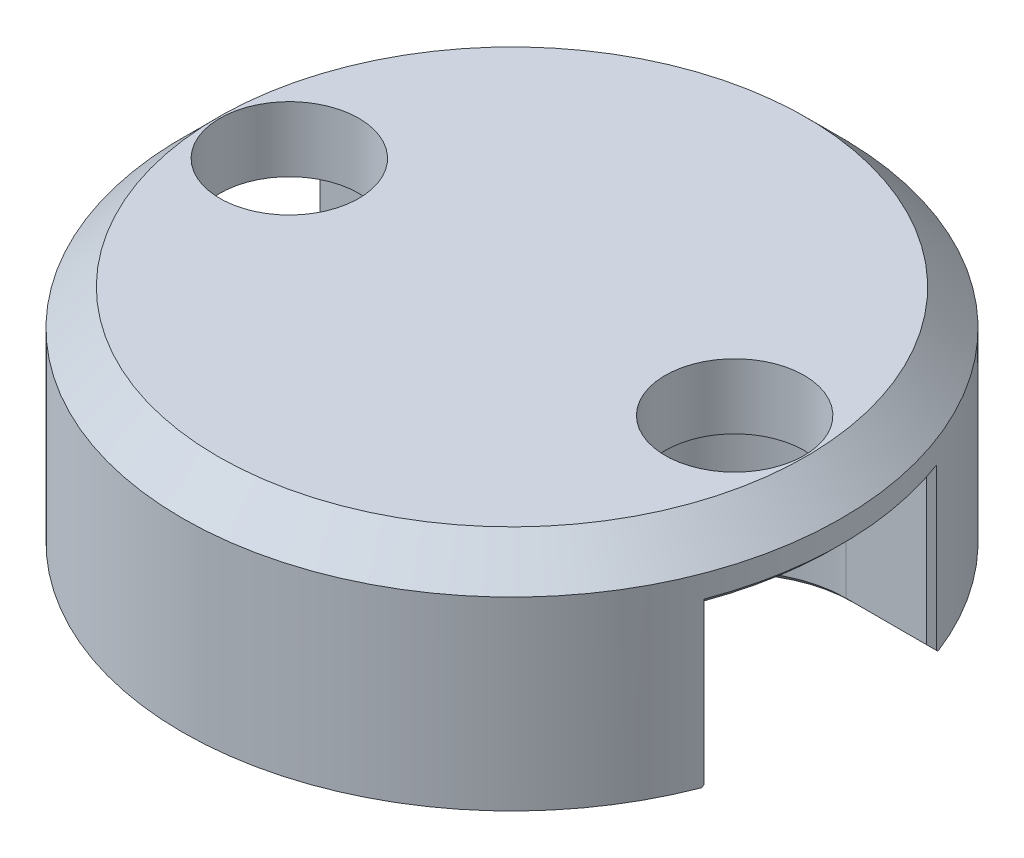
ISO-10303-21;
HEADER;
FILE_DESCRIPTION(('STEP AP214'),'2;1');
FILE_NAME('part.step','',(''),(''),'','','');
FILE_SCHEMA(('AUTOMOTIVE_DESIGN { 1 0 10303 214 1 1 1 1 }'));
ENDSEC;
DATA;
#1=APPLICATION_CONTEXT('core data for automotive mechanical design processes');
#2=APPLICATION_PROTOCOL_DEFINITION('international standard','automotive_design',2000,#1);
#3=PRODUCT_CONTEXT('',#1,'mechanical');
#4=PRODUCT('Part','Part','',(#3));
#5=PRODUCT_RELATED_PRODUCT_CATEGORY('part','',(#4));
#6=PRODUCT_DEFINITION_FORMATION('','',#4);
#7=PRODUCT_DEFINITION_CONTEXT('part definition',#1,'design');
#8=PRODUCT_DEFINITION('design','',#6,#7);
#9=PRODUCT_DEFINITION_SHAPE('','',#8);
#10=(LENGTH_UNIT() NAMED_UNIT(*) SI_UNIT(.MILLI.,.METRE.));
#11=(NAMED_UNIT(*) PLANE_ANGLE_UNIT() SI_UNIT($,.RADIAN.));
#12=(NAMED_UNIT(*) SI_UNIT($,.STERADIAN.) SOLID_ANGLE_UNIT());
#13=UNCERTAINTY_MEASURE_WITH_UNIT(LENGTH_MEASURE(1.E-05),#10,'distance_accuracy_value','');
#14=(GEOMETRIC_REPRESENTATION_CONTEXT(3) GLOBAL_UNCERTAINTY_ASSIGNED_CONTEXT((#13)) GLOBAL_UNIT_ASSIGNED_CONTEXT((#10,
#11,#12)) REPRESENTATION_CONTEXT('',''));
#15=CARTESIAN_POINT('',(0.,0.,0.));
#16=DIRECTION('',(0.,0.,1.));
#17=DIRECTION('',(1.,0.,0.));
#18=AXIS2_PLACEMENT_3D('',#15,#16,#17);
#19=CARTESIAN_POINT('',(0.,0.,0.));
#20=DIRECTION('',(0.,1.,0.));
#21=DIRECTION('',(0.,0.,1.));
#22=AXIS2_PLACEMENT_3D('',#19,#20,#21);
#23=PLANE('',#22);
#24=DIRECTION('',(-1.,0.,0.));
#25=VECTOR('',#24,1.);
#26=CARTESIAN_POINT('',(0.,0.,-3.37343749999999));
#27=LINE('',#26,#25);
#28=CARTESIAN_POINT('',(8.77167734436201,0.,-3.37343749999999));
#29=VERTEX_POINT('',#28);
#30=CARTESIAN_POINT('',(6.35,0.,-3.37343749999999));
#31=VERTEX_POINT('',#30);
#32=EDGE_CURVE('E581',#29,#31,#27,.T.);
#33=ORIENTED_EDGE('',*,*,#32,.T.);
#34=CARTESIAN_POINT('',(6.35,0.,0.));
#35=DIRECTION('',(0.,1.,0.));
#36=DIRECTION('',(0.,0.,1.));
#37=AXIS2_PLACEMENT_3D('',#34,#35,#36);
#38=CIRCLE('',#37,3.37343749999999);
#39=CARTESIAN_POINT('',(3.61757317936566,0.,-1.97836403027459));
#40=VERTEX_POINT('',#39);
#41=EDGE_CURVE('E583',#31,#40,#38,.T.);
#42=ORIENTED_EDGE('',*,*,#41,.T.);
#43=DIRECTION('',(-1.,0.,0.));
#44=VECTOR('',#43,1.);
#45=CARTESIAN_POINT('',(0.,0.,-1.97836403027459));
#46=LINE('',#45,#44);
#47=CARTESIAN_POINT('',(-3.61757317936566,0.,-1.97836403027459));
#48=VERTEX_POINT('',#47);
#49=EDGE_CURVE('E270',#40,#48,#46,.T.);
#50=ORIENTED_EDGE('',*,*,#49,.T.);
#51=CARTESIAN_POINT('',(-6.35,0.,0.));
#52=DIRECTION('',(0.,1.,0.));
#53=DIRECTION('',(0.,0.,1.));
#54=AXIS2_PLACEMENT_3D('',#51,#52,#53);
#55=CIRCLE('',#54,3.37343749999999);
#56=CARTESIAN_POINT('',(-6.35,0.,-3.37343749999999));
#57=VERTEX_POINT('',#56);
#58=EDGE_CURVE('E579',#48,#57,#55,.T.);
#59=ORIENTED_EDGE('',*,*,#58,.T.);
#60=DIRECTION('',(-1.,0.,0.));
#61=VECTOR('',#60,1.);
#62=CARTESIAN_POINT('',(0.,0.,-3.37343749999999));
#63=LINE('',#62,#61);
#64=CARTESIAN_POINT('',(-8.77167734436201,0.,-3.37343749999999));
#65=VERTEX_POINT('',#64);
#66=EDGE_CURVE('E577',#57,#65,#63,.T.);
#67=ORIENTED_EDGE('',*,*,#66,.T.);
#68=CARTESIAN_POINT('',(0.,0.,0.));
#69=DIRECTION('',(0.,1.,0.));
#70=DIRECTION('',(0.,0.,1.));
#71=AXIS2_PLACEMENT_3D('',#68,#69,#70);
#72=CIRCLE('',#71,9.398);
#73=EDGE_CURVE('E263',#29,#65,#72,.T.);
#74=ORIENTED_EDGE('',*,*,#73,.F.);
#75=EDGE_LOOP('',(#33,#42,#50,#59,#67,#74));
#76=FACE_BOUND('',#75,.T.);
#77=ADVANCED_FACE('F41',(#76),#23,.F.);
#78=CARTESIAN_POINT('',(-6.35,0.,0.));
#79=DIRECTION('',(0.,-1.,0.));
#80=DIRECTION('',(0.,0.,-1.));
#81=AXIS2_PLACEMENT_3D('',#78,#79,#80);
#82=CYLINDRICAL_SURFACE('',#81,3.175);
#83=CARTESIAN_POINT('',(-4.02693882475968,0.198437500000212,2.16425778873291));
#84=CARTESIAN_POINT('',(-3.7762331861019,0.495950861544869,1.89535598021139));
#85=CARTESIAN_POINT('',(-3.57287762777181,0.842117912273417,1.58247945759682));
#86=CARTESIAN_POINT('',(-3.42893444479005,1.21640531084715,1.24418689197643));
#87=B_SPLINE_CURVE_WITH_KNOTS('',3,(#83,#84,#85,#86),.UNSPECIFIED.,.F.,.F.,(4,4),
(0.8207727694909,1.16813317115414),.UNSPECIFIED.);
#88=CARTESIAN_POINT('',(-3.44991272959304,1.16313885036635,1.29233077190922));
#89=VERTEX_POINT('',#88);
#90=CARTESIAN_POINT('',(-4.02693882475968,0.198437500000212,2.16425778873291));
#91=VERTEX_POINT('',#90);
#92=EDGE_CURVE('E631',#89,#91,#87,.F.);
#93=ORIENTED_EDGE('',*,*,#92,.T.);
#94=CARTESIAN_POINT('',(-6.35,0.198437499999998,0.));
#95=DIRECTION('',(0.,1.,0.));
#96=DIRECTION('',(0.,0.,1.));
#97=AXIS2_PLACEMENT_3D('',#94,#95,#96);
#98=CIRCLE('',#97,3.175);
#99=CARTESIAN_POINT('',(-6.35,0.198437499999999,3.175));
#100=VERTEX_POINT('',#99);
#101=EDGE_CURVE('E634',#91,#100,#98,.F.);
#102=ORIENTED_EDGE('',*,*,#101,.T.);
#103=DIRECTION('',(0.,-1.,0.));
#104=VECTOR('',#103,1.);
#105=CARTESIAN_POINT('',(-6.35,15.8926252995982,3.175));
#106=LINE('',#105,#104);
#107=CARTESIAN_POINT('',(-6.35,4.445,3.175));
#108=VERTEX_POINT('',#107);
#109=EDGE_CURVE('E245',#108,#100,#106,.T.);
#110=ORIENTED_EDGE('',*,*,#109,.F.);
#111=CARTESIAN_POINT('',(-6.35,4.445,0.));
#112=DIRECTION('',(0.,-1.,0.));
#113=DIRECTION('',(0.,0.,-1.));
#114=AXIS2_PLACEMENT_3D('',#111,#112,#113);
#115=CIRCLE('',#114,3.175);
#116=CARTESIAN_POINT('',(-6.35,4.445,-3.175));
#117=VERTEX_POINT('',#116);
#118=EDGE_CURVE('E231',#117,#108,#115,.T.);
#119=ORIENTED_EDGE('',*,*,#118,.F.);
#120=DIRECTION('',(0.,-1.,0.));
#121=VECTOR('',#120,1.);
#122=CARTESIAN_POINT('',(-6.35,15.8926252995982,-3.175));
#123=LINE('',#122,#121);
#124=CARTESIAN_POINT('',(-6.35,0.198437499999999,-3.175));
#125=VERTEX_POINT('',#124);
#126=EDGE_CURVE('E236',#117,#125,#123,.T.);
#127=ORIENTED_EDGE('',*,*,#126,.T.);
#128=CARTESIAN_POINT('',(-6.35,0.198437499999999,0.));
#129=DIRECTION('',(0.,1.,0.));
#130=DIRECTION('',(0.,0.,1.));
#131=AXIS2_PLACEMENT_3D('',#128,#129,#130);
#132=CIRCLE('',#131,3.175);
#133=CARTESIAN_POINT('',(-4.02693882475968,0.198437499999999,-2.16425778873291));
#134=VERTEX_POINT('',#133);
#135=EDGE_CURVE('E597',#125,#134,#132,.F.);
#136=ORIENTED_EDGE('',*,*,#135,.T.);
#137=CARTESIAN_POINT('',(-3.42893444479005,1.21640531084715,-1.24418689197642));
#138=CARTESIAN_POINT('',(-3.5728776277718,0.842117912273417,-1.58247945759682));
#139=CARTESIAN_POINT('',(-3.7762331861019,0.495950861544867,-1.8953559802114));
#140=CARTESIAN_POINT('',(-4.02693882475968,0.198437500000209,-2.16425778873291));
#141=B_SPLINE_CURVE_WITH_KNOTS('',3,(#137,#138,#139,#140),.UNSPECIFIED.,.F.,.F.,(4,4),
(5.11505213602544,5.46241253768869),.UNSPECIFIED.);
#142=CARTESIAN_POINT('',(-3.44990515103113,1.16313451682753,-1.29233171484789));
#143=VERTEX_POINT('',#142);
#144=EDGE_CURVE('E600',#134,#143,#141,.F.);
#145=ORIENTED_EDGE('',*,*,#144,.T.);
#146=CARTESIAN_POINT('',(-3.44991272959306,1.16313885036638,1.29233077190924));
#147=CARTESIAN_POINT('',(-3.44060046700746,1.18596865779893,1.2719606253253));
#148=CARTESIAN_POINT('',(-3.43136525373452,1.20829027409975,1.25098544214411));
#149=CARTESIAN_POINT('',(-3.41312689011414,1.25180320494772,1.20793754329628));
#150=CARTESIAN_POINT('',(-3.4041231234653,1.27299772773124,1.18586833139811));
#151=CARTESIAN_POINT('',(-3.38639803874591,1.31421294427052,1.14069588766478));
#152=CARTESIAN_POINT('',(-3.37767588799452,1.33423727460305,1.11759630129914));
#153=CARTESIAN_POINT('',(-3.36056468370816,1.37306817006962,1.07042636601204));
#154=CARTESIAN_POINT('',(-3.35217455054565,1.39187883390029,1.04635978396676));
#155=CARTESIAN_POINT('',(-3.3357780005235,1.42823851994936,0.997319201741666));
#156=CARTESIAN_POINT('',(-3.32777023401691,1.44579210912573,0.972349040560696));
#157=CARTESIAN_POINT('',(-3.31218907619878,1.47959373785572,0.921564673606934));
#158=CARTESIAN_POINT('',(-3.30461405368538,1.49584678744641,0.895754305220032));
#159=CARTESIAN_POINT('',(-3.2899490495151,1.52700346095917,0.843352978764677));
#160=CARTESIAN_POINT('',(-3.28285716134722,1.54191247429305,0.816765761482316));
#161=CARTESIAN_POINT('',(-3.26920908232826,1.57033726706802,0.762874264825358));
#162=CARTESIAN_POINT('',(-3.26265074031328,1.58385870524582,0.735573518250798));
#163=CARTESIAN_POINT('',(-3.25012038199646,1.60946464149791,0.680318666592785));
#164=CARTESIAN_POINT('',(-3.24414603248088,1.62155490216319,0.652367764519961));
#165=CARTESIAN_POINT('',(-3.23283419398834,1.64425499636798,0.595876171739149));
#166=CARTESIAN_POINT('',(-3.22749429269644,1.65487046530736,0.567338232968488));
#167=CARTESIAN_POINT('',(-3.21750186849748,1.6745775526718,0.509737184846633));
#168=CARTESIAN_POINT('',(-3.21284700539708,1.68367437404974,0.480676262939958));
#169=CARTESIAN_POINT('',(-3.20427466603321,1.70030171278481,0.422090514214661));
#170=CARTESIAN_POINT('',(-3.20035513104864,1.70783660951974,0.392567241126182));
#171=CARTESIAN_POINT('',(-3.19506466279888,1.71793567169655,0.347968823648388));
#172=CARTESIAN_POINT('',(-3.19340032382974,1.72109958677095,0.33306154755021));
#173=CARTESIAN_POINT('',(-3.19027450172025,1.72702041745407,0.303155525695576));
#174=CARTESIAN_POINT('',(-3.18881287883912,1.72977761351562,0.288156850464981));
#175=CARTESIAN_POINT('',(-3.18609882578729,1.73487950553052,0.258076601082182));
#176=CARTESIAN_POINT('',(-3.18484631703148,1.73722435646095,0.242995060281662));
#177=CARTESIAN_POINT('',(-3.18255670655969,1.74149629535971,0.212756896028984));
#178=CARTESIAN_POINT('',(-3.18151959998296,1.7434233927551,0.197600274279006));
#179=CARTESIAN_POINT('',(-3.17966701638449,1.74685453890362,0.167219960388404));
#180=CARTESIAN_POINT('',(-3.17885162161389,1.7483584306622,0.151996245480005));
#181=CARTESIAN_POINT('',(-3.17744869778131,1.75093785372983,0.121489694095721));
#182=CARTESIAN_POINT('',(-3.1768613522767,1.75201303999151,0.106206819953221));
#183=CARTESIAN_POINT('',(-3.1759206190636,1.75372999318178,0.0755899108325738));
#184=CARTESIAN_POINT('',(-3.17556753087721,1.75437120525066,0.0602558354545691));
#185=CARTESIAN_POINT('',(-3.17510188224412,1.7552142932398,0.0295444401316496));
#186=CARTESIAN_POINT('',(-3.17498975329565,1.75541538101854,0.0141670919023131));
#187=CARTESIAN_POINT('',(-3.17501070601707,1.75537567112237,-0.0165843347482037));
#188=CARTESIAN_POINT('',(-3.17514374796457,1.75513494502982,-0.0319584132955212));
#189=CARTESIAN_POINT('',(-3.17564842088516,1.75421760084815,-0.0626571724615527));
#190=CARTESIAN_POINT('',(-3.17601954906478,1.75354190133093,-0.0779818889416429));
#191=CARTESIAN_POINT('',(-3.17699443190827,1.75175944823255,-0.108574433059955));
#192=CARTESIAN_POINT('',(-3.17759781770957,1.75065337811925,-0.123842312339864));
#193=CARTESIAN_POINT('',(-3.17903077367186,1.74801588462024,-0.154313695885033));
#194=CARTESIAN_POINT('',(-3.17986009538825,1.74648492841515,-0.169517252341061));
#195=CARTESIAN_POINT('',(-3.18173862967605,1.74300310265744,-0.199852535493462));
#196=CARTESIAN_POINT('',(-3.18278769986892,1.74105250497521,-0.214984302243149));
#197=CARTESIAN_POINT('',(-3.18509940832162,1.73673689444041,-0.245168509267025));
#198=CARTESIAN_POINT('',(-3.18636199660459,1.73437197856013,-0.260220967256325));
#199=CARTESIAN_POINT('',(-3.1890944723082,1.7292331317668,-0.290239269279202));
#200=CARTESIAN_POINT('',(-3.19056438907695,1.72645914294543,-0.305205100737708));
#201=CARTESIAN_POINT('',(-3.19370514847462,1.72050776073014,-0.335042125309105));
#202=CARTESIAN_POINT('',(-3.19537608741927,1.71733017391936,-0.349913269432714));
#203=CARTESIAN_POINT('',(-3.20068357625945,1.70719526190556,-0.394395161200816));
#204=CARTESIAN_POINT('',(-3.20461146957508,1.69964201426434,-0.423838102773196));
#205=CARTESIAN_POINT('',(-3.21319513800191,1.68298805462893,-0.48225551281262));
#206=CARTESIAN_POINT('',(-3.2178527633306,1.67388340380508,-0.511228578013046));
#207=CARTESIAN_POINT('',(-3.22784598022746,1.65416968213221,-0.568649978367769));
#208=CARTESIAN_POINT('',(-3.2331837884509,1.64355567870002,-0.597096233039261));
#209=CARTESIAN_POINT('',(-3.24448737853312,1.62086647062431,-0.653404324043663));
#210=CARTESIAN_POINT('',(-3.25045552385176,1.60878573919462,-0.681263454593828));
#211=CARTESIAN_POINT('',(-3.26297009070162,1.58320573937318,-0.736338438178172));
#212=CARTESIAN_POINT('',(-3.26951885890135,1.56970066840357,-0.763551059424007));
#213=CARTESIAN_POINT('',(-3.28314509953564,1.54131439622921,-0.81727380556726));
#214=CARTESIAN_POINT('',(-3.2902247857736,1.52642736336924,-0.843780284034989));
#215=CARTESIAN_POINT('',(-3.30486340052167,1.49531932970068,-0.896031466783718));
#216=CARTESIAN_POINT('',(-3.31242433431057,1.47909265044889,-0.921772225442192));
#217=CARTESIAN_POINT('',(-3.32797604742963,1.44534731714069,-0.972432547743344));
#218=CARTESIAN_POINT('',(-3.33596858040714,1.42782326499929,-0.997347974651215));
#219=CARTESIAN_POINT('',(-3.35233412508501,1.39152506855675,-1.04629810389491));
#220=CARTESIAN_POINT('',(-3.36070862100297,1.37274588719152,-1.07032857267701));
#221=CARTESIAN_POINT('',(-3.37778875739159,1.33397921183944,-1.11744915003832));
#222=CARTESIAN_POINT('',(-3.38649561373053,1.31398708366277,-1.14053500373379));
#223=CARTESIAN_POINT('',(-3.40419105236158,1.27283636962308,-1.18570665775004));
#224=CARTESIAN_POINT('',(-3.41318059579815,1.25167356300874,-1.20778823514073));
#225=CARTESIAN_POINT('',(-3.43139227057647,1.20822291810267,-1.25089150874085));
#226=CARTESIAN_POINT('',(-3.44061513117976,1.18593125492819,-1.27190904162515));
#227=CARTESIAN_POINT('',(-3.44991314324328,1.16313782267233,-1.29233170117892));
#228=B_SPLINE_CURVE_WITH_KNOTS('',3,(#146,#147,#148,#149,#150,#151,#152,#153,#154,#155,#156,
#157,#158,#159,#160,#161,#162,#163,#164,#165,#166,#167,#168,#169,#170,#171,#172,#173,#174,#175,
#176,#177,#178,#179,#180,#181,#182,#183,#184,#185,#186,#187,#188,#189,#190,#191,#192,#193,#194,
#195,#196,#197,#198,#199,#200,#201,#202,#203,#204,#205,#206,#207,#208,#209,#210,#211,#212,#213,
#214,#215,#216,#217,#218,#219,#220,#221,#222,#223,#224,#225,#226,#227),.UNSPECIFIED.,.F.,.F.,(4,
2,2,2,2,2,2,2,2,2,2,2,2,2,2,2,2,2,2,2,2,2,2,2,2,2,2,2,2,2,2,2,2,2,2,2,2,2,2,2,4),(0.,
0.0959370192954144,0.191584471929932,0.286916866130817,0.381908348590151,0.476535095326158,
0.570777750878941,0.664623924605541,0.758070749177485,0.851127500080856,0.943818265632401,
1.03618464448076,1.12828843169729,1.17427251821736,1.22022474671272,1.2661596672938,
1.31209355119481,1.3580444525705,1.40403226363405,1.4500787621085,1.49620764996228,
1.54232906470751,1.58835339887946,1.63430493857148,1.6802061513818,1.72607771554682,
1.7719385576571,1.8178058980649,1.86369530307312,1.95558477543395,2.04771111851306,
2.1401457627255,2.23294020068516,2.32612845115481,2.41972955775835,2.51375007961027,
2.6081865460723,2.70302786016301,2.79825764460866,2.89385653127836,2.98980439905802),.UNSPECIFIED.);
#229=EDGE_CURVE('E635',#143,#89,#228,.F.);
#230=ORIENTED_EDGE('',*,*,#229,.T.);
#231=EDGE_LOOP('',(#93,#102,#110,#119,#127,#136,#145,#230));
#232=FACE_BOUND('',#231,.T.);
#233=ADVANCED_FACE('F248',(#232),#82,.F.);
#234=CARTESIAN_POINT('',(6.35,0.,0.));
#235=DIRECTION('',(0.,-1.,0.));
#236=DIRECTION('',(0.,0.,-1.));
#237=AXIS2_PLACEMENT_3D('',#234,#235,#236);
#238=CYLINDRICAL_SURFACE('',#237,3.175);
#239=DIRECTION('',(0.,-1.,0.));
#240=VECTOR('',#239,1.);
#241=CARTESIAN_POINT('',(6.35,15.8926252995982,3.175));
#242=LINE('',#241,#240);
#243=CARTESIAN_POINT('',(6.35,4.445,3.175));
#244=VERTEX_POINT('',#243);
#245=CARTESIAN_POINT('',(6.35,0.198437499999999,3.175));
#246=VERTEX_POINT('',#245);
#247=EDGE_CURVE('E781',#244,#246,#242,.T.);
#248=ORIENTED_EDGE('',*,*,#247,.T.);
#249=CARTESIAN_POINT('',(6.35,0.198437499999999,0.));
#250=DIRECTION('',(0.,1.,0.));
#251=DIRECTION('',(0.,0.,1.));
#252=AXIS2_PLACEMENT_3D('',#249,#250,#251);
#253=CIRCLE('',#252,3.175);
#254=CARTESIAN_POINT('',(4.02693882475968,0.198437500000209,2.16425778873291));
#255=VERTEX_POINT('',#254);
#256=EDGE_CURVE('E324',#246,#255,#253,.F.);
#257=ORIENTED_EDGE('',*,*,#256,.T.);
#258=CARTESIAN_POINT('',(3.42893444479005,1.21640531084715,1.24418689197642));
#259=CARTESIAN_POINT('',(3.5728776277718,0.842117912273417,1.58247945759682));
#260=CARTESIAN_POINT('',(3.7762331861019,0.495950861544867,1.8953559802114));
#261=CARTESIAN_POINT('',(4.02693882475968,0.198437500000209,2.16425778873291));
#262=B_SPLINE_CURVE_WITH_KNOTS('',3,(#258,#259,#260,#261),.UNSPECIFIED.,.F.,.F.,(4,4),
(5.11505213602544,5.46241253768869),.UNSPECIFIED.);
#263=CARTESIAN_POINT('',(3.44991316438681,1.1631377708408,1.29233174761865));
#264=VERTEX_POINT('',#263);
#265=EDGE_CURVE('E317',#255,#264,#262,.F.);
#266=ORIENTED_EDGE('',*,*,#265,.T.);
#267=CARTESIAN_POINT('',(3.44991272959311,1.16313885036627,-1.29233077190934));
#268=CARTESIAN_POINT('',(3.44060046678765,1.18596865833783,-1.27196062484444));
#269=CARTESIAN_POINT('',(3.43136525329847,1.2082902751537,-1.25098544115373));
#270=CARTESIAN_POINT('',(3.41312688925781,1.25180320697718,-1.20793754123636));
#271=CARTESIAN_POINT('',(3.40412312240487,1.27299773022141,-1.18586832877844));
#272=CARTESIAN_POINT('',(3.38639803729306,1.31421294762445,-1.14069588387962));
#273=CARTESIAN_POINT('',(3.37767588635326,1.33423727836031,-1.11759629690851));
#274=CARTESIAN_POINT('',(3.36056468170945,1.37306817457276,-1.07042636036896));
#275=CARTESIAN_POINT('',(3.35217454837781,1.39187883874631,-1.04635977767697));
#276=CARTESIAN_POINT('',(3.33577799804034,1.42823852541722,-0.99731919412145));
#277=CARTESIAN_POINT('',(3.32777023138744,1.44579211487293,-0.972349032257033));
#278=CARTESIAN_POINT('',(3.31218907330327,1.47959374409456,-0.921564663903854));
#279=CARTESIAN_POINT('',(3.30461405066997,1.49584679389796,-0.895754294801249));
#280=CARTESIAN_POINT('',(3.28994904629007,1.52700346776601,-0.843352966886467));
#281=CARTESIAN_POINT('',(3.28285715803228,1.54191248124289,-0.816765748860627));
#282=CARTESIAN_POINT('',(3.26920907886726,1.57033727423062,-0.762874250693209));
#283=CARTESIAN_POINT('',(3.26265073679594,1.58385871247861,-0.735573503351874));
#284=CARTESIAN_POINT('',(3.25012037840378,1.60946464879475,-0.680318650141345));
#285=CARTESIAN_POINT('',(3.24414602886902,1.62155490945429,-0.652367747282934));
#286=CARTESIAN_POINT('',(3.23283419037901,1.64425500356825,-0.59587615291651));
#287=CARTESIAN_POINT('',(3.22749428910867,1.65487047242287,-0.567338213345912));
#288=CARTESIAN_POINT('',(3.21750186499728,1.67457755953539,-0.509737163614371));
#289=CARTESIAN_POINT('',(3.21284700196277,1.6836743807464,-0.480676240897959));
#290=CARTESIAN_POINT('',(3.20427466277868,1.70030171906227,-0.422090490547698));
#291=CARTESIAN_POINT('',(3.20035512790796,1.70783661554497,-0.392567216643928));
#292=CARTESIAN_POINT('',(3.19506465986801,1.7179356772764,-0.347968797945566));
#293=CARTESIAN_POINT('',(3.19340032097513,1.72109959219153,-0.333061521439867));
#294=CARTESIAN_POINT('',(3.19027449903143,1.72702042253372,-0.303155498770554));
#295=CARTESIAN_POINT('',(3.18881287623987,1.72977761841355,-0.288156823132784));
#296=CARTESIAN_POINT('',(3.18609882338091,1.73487951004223,-0.258076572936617));
#297=CARTESIAN_POINT('',(3.18484631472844,1.73722436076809,-0.242995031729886));
#298=CARTESIAN_POINT('',(3.1825567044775,1.74149629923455,-0.212756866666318));
#299=CARTESIAN_POINT('',(3.18151959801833,1.74342339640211,-0.197600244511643));
#300=CARTESIAN_POINT('',(3.17966701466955,1.74685454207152,-0.167219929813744));
#301=CARTESIAN_POINT('',(3.17885162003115,1.74835843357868,-0.15199621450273));
#302=CARTESIAN_POINT('',(3.17744869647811,1.75093785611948,-0.121489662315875));
#303=CARTESIAN_POINT('',(3.17686135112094,1.7520130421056,-0.106206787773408));
#304=CARTESIAN_POINT('',(3.1759206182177,1.75372999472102,-0.0755898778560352));
#305=CARTESIAN_POINT('',(3.17556753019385,1.75437120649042,-0.060255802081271));
#306=CARTESIAN_POINT('',(3.17510188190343,1.75521429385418,-0.0295444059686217));
#307=CARTESIAN_POINT('',(3.17498975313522,1.75541538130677,-0.0141670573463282));
#308=CARTESIAN_POINT('',(3.17501070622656,1.75537567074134,0.0165843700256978));
#309=CARTESIAN_POINT('',(3.1751437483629,1.75513494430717,0.0319584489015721));
#310=CARTESIAN_POINT('',(3.1756484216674,1.75421759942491,0.0626572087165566));
#311=CARTESIAN_POINT('',(3.17601955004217,1.75354189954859,0.0779819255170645));
#312=CARTESIAN_POINT('',(3.17699443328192,1.75175944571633,0.108574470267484));
#313=CARTESIAN_POINT('',(3.17759781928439,1.75065337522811,0.123842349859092));
#314=CARTESIAN_POINT('',(3.17903077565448,1.74801588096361,0.154313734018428));
#315=CARTESIAN_POINT('',(3.17986009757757,1.74648492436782,0.169517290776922));
#316=CARTESIAN_POINT('',(3.18173863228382,1.74300309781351,0.199852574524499));
#317=CARTESIAN_POINT('',(3.18278770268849,1.74105249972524,0.214984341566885));
#318=CARTESIAN_POINT('',(3.18509941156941,1.73673688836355,0.245168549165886));
#319=CARTESIAN_POINT('',(3.18636200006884,1.73437197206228,0.260221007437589));
#320=CARTESIAN_POINT('',(3.18909447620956,1.72923312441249,0.290239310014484));
#321=CARTESIAN_POINT('',(3.19056439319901,1.72645913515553,0.305205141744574));
#322=CARTESIAN_POINT('',(3.19370515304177,1.72050775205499,0.335042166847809));
#323=CARTESIAN_POINT('',(3.19537609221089,1.71733016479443,0.349913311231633));
#324=CARTESIAN_POINT('',(3.20068358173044,1.70719525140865,0.394395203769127));
#325=CARTESIAN_POINT('',(3.20461147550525,1.69964200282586,0.423838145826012));
#326=CARTESIAN_POINT('',(3.21319514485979,1.68298804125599,0.482255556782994));
#327=CARTESIAN_POINT('',(3.2178527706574,1.67388338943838,0.511228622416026));
#328=CARTESIAN_POINT('',(3.22784598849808,1.65416966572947,0.568650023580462));
#329=CARTESIAN_POINT('',(3.2331837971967,1.64355566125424,0.59709627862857));
#330=CARTESIAN_POINT('',(3.24448738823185,1.62086645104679,0.653404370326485));
#331=CARTESIAN_POINT('',(3.25045553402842,1.60878571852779,0.681263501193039));
#332=CARTESIAN_POINT('',(3.26297010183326,1.58320571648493,0.736338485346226));
#333=CARTESIAN_POINT('',(3.26951887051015,1.56970064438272,0.763551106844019));
#334=CARTESIAN_POINT('',(3.28314511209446,1.54131436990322,0.817273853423));
#335=CARTESIAN_POINT('',(3.29022479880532,1.52642733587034,0.843780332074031));
#336=CARTESIAN_POINT('',(3.30486341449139,1.49531929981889,0.896031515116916));
#337=CARTESIAN_POINT('',(3.31242434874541,1.47909261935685,0.921772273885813));
#338=CARTESIAN_POINT('',(3.32797606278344,1.44534728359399,0.972432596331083));
#339=CARTESIAN_POINT('',(3.33596859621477,1.42782323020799,0.997348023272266));
#340=CARTESIAN_POINT('',(3.35233414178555,1.39152503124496,1.04629815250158));
#341=CARTESIAN_POINT('',(3.36070863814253,1.37274584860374,1.07032862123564));
#342=CARTESIAN_POINT('',(3.37778877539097,1.33397917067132,1.11744919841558));
#343=CARTESIAN_POINT('',(3.38649563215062,1.31398704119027,1.14053505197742));
#344=CARTESIAN_POINT('',(3.40419107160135,1.27283632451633,1.18570670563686));
#345=CARTESIAN_POINT('',(3.41318061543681,1.25167351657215,1.20778828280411));
#346=CARTESIAN_POINT('',(3.43139229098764,1.20822286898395,1.25089155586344));
#347=CARTESIAN_POINT('',(3.44061515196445,1.18593120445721,1.27190908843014));
#348=CARTESIAN_POINT('',(3.44991316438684,1.16313777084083,1.29233174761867));
#349=B_SPLINE_CURVE_WITH_KNOTS('',3,(#267,#268,#269,#270,#271,#272,#273,#274,#275,#276,#277,
#278,#279,#280,#281,#282,#283,#284,#285,#286,#287,#288,#289,#290,#291,#292,#293,#294,#295,#296,
#297,#298,#299,#300,#301,#302,#303,#304,#305,#306,#307,#308,#309,#310,#311,#312,#313,#314,#315,
#316,#317,#318,#319,#320,#321,#322,#323,#324,#325,#326,#327,#328,#329,#330,#331,#332,#333,#334,
#335,#336,#337,#338,#339,#340,#341,#342,#343,#344,#345,#346,#347,#348),.UNSPECIFIED.,.F.,.F.,(4,
2,2,2,2,2,2,2,2,2,2,2,2,2,2,2,2,2,2,2,2,2,2,2,2,2,2,2,2,2,2,2,2,2,2,2,2,2,2,2,4),(0.,
0.0959370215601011,0.191584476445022,0.286916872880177,0.38190835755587,0.476535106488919,
0.570777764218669,0.664623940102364,0.758070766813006,0.851127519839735,0.943818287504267,
1.03618466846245,1.12828845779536,1.17427254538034,1.22022477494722,1.26615969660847,
1.31209358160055,1.35804448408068,1.40403229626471,1.45007879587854,1.49620768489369,
1.54232910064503,1.58835343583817,1.63430497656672,1.68020619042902,1.72607775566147,
1.77193859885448,1.81780594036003,1.86369534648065,1.95558482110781,2.04771116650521,
2.14014581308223,2.23294025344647,2.3261285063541,2.41972961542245,2.51375013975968,
2.60818660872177,2.70302792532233,2.79825771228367,2.89385660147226,2.98980447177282),.UNSPECIFIED.);
#350=CARTESIAN_POINT('',(3.44990528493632,1.16313418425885,-1.29233201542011));
#351=VERTEX_POINT('',#350);
#352=EDGE_CURVE('E321',#264,#351,#349,.F.);
#353=ORIENTED_EDGE('',*,*,#352,.T.);
#354=CARTESIAN_POINT('',(4.02693882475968,0.198437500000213,-2.16425778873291));
#355=CARTESIAN_POINT('',(3.77623318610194,0.495950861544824,-1.89535598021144));
#356=CARTESIAN_POINT('',(3.57287762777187,0.842117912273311,-1.58247945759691));
#357=CARTESIAN_POINT('',(3.42893444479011,1.21640531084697,-1.24418689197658));
#358=B_SPLINE_CURVE_WITH_KNOTS('',3,(#354,#355,#356,#357),.UNSPECIFIED.,.F.,.F.,(4,4),
(0.820772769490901,1.16813317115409),.UNSPECIFIED.);
#359=CARTESIAN_POINT('',(4.02693882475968,0.198437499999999,-2.16425778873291));
#360=VERTEX_POINT('',#359);
#361=EDGE_CURVE('E278',#351,#360,#358,.F.);
#362=ORIENTED_EDGE('',*,*,#361,.T.);
#363=CARTESIAN_POINT('',(6.35,0.198437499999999,0.));
#364=DIRECTION('',(0.,1.,0.));
#365=DIRECTION('',(0.,0.,1.));
#366=AXIS2_PLACEMENT_3D('',#363,#364,#365);
#367=CIRCLE('',#366,3.175);
#368=CARTESIAN_POINT('',(6.35,0.198437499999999,-3.175));
#369=VERTEX_POINT('',#368);
#370=EDGE_CURVE('E273',#360,#369,#367,.F.);
#371=ORIENTED_EDGE('',*,*,#370,.T.);
#372=DIRECTION('',(0.,-1.,0.));
#373=VECTOR('',#372,1.);
#374=CARTESIAN_POINT('',(6.35,15.8926252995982,-3.175));
#375=LINE('',#374,#373);
#376=CARTESIAN_POINT('',(6.35,4.445,-3.175));
#377=VERTEX_POINT('',#376);
#378=EDGE_CURVE('E783',#377,#369,#375,.T.);
#379=ORIENTED_EDGE('',*,*,#378,.F.);
#380=CARTESIAN_POINT('',(6.35,4.445,0.));
#381=DIRECTION('',(0.,-1.,0.));
#382=DIRECTION('',(0.,0.,-1.));
#383=AXIS2_PLACEMENT_3D('',#380,#381,#382);
#384=CIRCLE('',#383,3.175);
#385=EDGE_CURVE('E786',#244,#377,#384,.T.);
#386=ORIENTED_EDGE('',*,*,#385,.F.);
#387=EDGE_LOOP('',(#248,#257,#266,#353,#362,#371,#379,#386));
#388=FACE_BOUND('',#387,.T.);
#389=ADVANCED_FACE('F284',(#388),#238,.F.);
#390=DIRECTION('',(1.,0.,0.));
#391=VECTOR('',#390,1.);
#392=CARTESIAN_POINT('',(0.,0.,1.97836403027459));
#393=LINE('',#392,#391);
#394=CARTESIAN_POINT('',(-3.61757317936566,0.,1.97836403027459));
#395=VERTEX_POINT('',#394);
#396=CARTESIAN_POINT('',(3.61757317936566,0.,1.97836403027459));
#397=VERTEX_POINT('',#396);
#398=EDGE_CURVE('E267',#395,#397,#393,.T.);
#399=ORIENTED_EDGE('',*,*,#398,.T.);
#400=CARTESIAN_POINT('',(6.35,0.,0.));
#401=DIRECTION('',(0.,1.,0.));
#402=DIRECTION('',(0.,0.,1.));
#403=AXIS2_PLACEMENT_3D('',#400,#401,#402);
#404=CIRCLE('',#403,3.37343749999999);
#405=CARTESIAN_POINT('',(6.35,0.,3.37343749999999));
#406=VERTEX_POINT('',#405);
#407=EDGE_CURVE('E534',#397,#406,#404,.T.);
#408=ORIENTED_EDGE('',*,*,#407,.T.);
#409=DIRECTION('',(1.,0.,0.));
#410=VECTOR('',#409,1.);
#411=CARTESIAN_POINT('',(0.,0.,3.37343749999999));
#412=LINE('',#411,#410);
#413=CARTESIAN_POINT('',(8.77167734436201,0.,3.37343749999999));
#414=VERTEX_POINT('',#413);
#415=EDGE_CURVE('E547',#406,#414,#412,.T.);
#416=ORIENTED_EDGE('',*,*,#415,.T.);
#417=CARTESIAN_POINT('',(-8.77167734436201,0.,3.37343749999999));
#418=VERTEX_POINT('',#417);
#419=EDGE_CURVE('E266',#418,#414,#72,.T.);
#420=ORIENTED_EDGE('',*,*,#419,.F.);
#421=DIRECTION('',(1.,0.,0.));
#422=VECTOR('',#421,1.);
#423=CARTESIAN_POINT('',(0.,0.,3.37343749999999));
#424=LINE('',#423,#422);
#425=CARTESIAN_POINT('',(-6.35,0.,3.37343749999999));
#426=VERTEX_POINT('',#425);
#427=EDGE_CURVE('E551',#418,#426,#424,.T.);
#428=ORIENTED_EDGE('',*,*,#427,.T.);
#429=CARTESIAN_POINT('',(-6.35,0.,0.));
#430=DIRECTION('',(0.,1.,0.));
#431=DIRECTION('',(0.,0.,1.));
#432=AXIS2_PLACEMENT_3D('',#429,#430,#431);
#433=CIRCLE('',#432,3.37343749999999);
#434=EDGE_CURVE('E537',#426,#395,#433,.T.);
#435=ORIENTED_EDGE('',*,*,#434,.T.);
#436=EDGE_LOOP('',(#399,#408,#416,#420,#428,#435));
#437=FACE_BOUND('',#436,.T.);
#438=ADVANCED_FACE('F294',(#437),#23,.F.);
#439=CARTESIAN_POINT('',(0.,6.2992,0.));
#440=DIRECTION('',(0.,-1.,0.));
#441=DIRECTION('',(0.,0.,-1.));
#442=AXIS2_PLACEMENT_3D('',#439,#440,#441);
#443=CYLINDRICAL_SURFACE('',#442,9.398);
#444=CARTESIAN_POINT('',(0.,5.28319999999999,0.));
#445=DIRECTION('',(0.,1.,0.));
#446=DIRECTION('',(0.,0.,1.));
#447=AXIS2_PLACEMENT_3D('',#444,#445,#446);
#448=CIRCLE('',#447,9.398);
#449=CARTESIAN_POINT('',(0.,5.28319999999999,9.398));
#450=VERTEX_POINT('',#449);
#451=EDGE_CURVE('E12',#450,#450,#448,.F.);
#452=ORIENTED_EDGE('',*,*,#451,.T.);
#453=EDGE_LOOP('',(#452));
#454=FACE_BOUND('',#453,.T.);
#455=ORIENTED_EDGE('',*,*,#419,.T.);
#456=CARTESIAN_POINT('',(0.,3.37343750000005,0.));
#457=DIRECTION('',(0.,0.707106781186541,0.707106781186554));
#458=DIRECTION('',(0.,-0.707106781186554,0.707106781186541));
#459=AXIS2_PLACEMENT_3D('',#456,#457,#458);
#460=ELLIPSE('',#459,13.2907790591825,9.398);
#461=CARTESIAN_POINT('',(8.79203077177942,0.0534075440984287,3.32002995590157));
#462=VERTEX_POINT('',#461);
#463=EDGE_CURVE('E575',#414,#462,#460,.T.);
#464=ORIENTED_EDGE('',*,*,#463,.T.);
#465=DIRECTION('',(0.,-1.,0.));
#466=VECTOR('',#465,1.);
#467=CARTESIAN_POINT('',(8.79203077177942,6.2992,3.32002995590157));
#468=LINE('',#467,#466);
#469=CARTESIAN_POINT('',(8.79203077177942,4.6434375,3.32002995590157));
#470=VERTEX_POINT('',#469);
#471=EDGE_CURVE('E569',#462,#470,#468,.F.);
#472=ORIENTED_EDGE('',*,*,#471,.T.);
#473=CARTESIAN_POINT('',(0.,4.6434375,0.));
#474=DIRECTION('',(0.,1.,0.));
#475=DIRECTION('',(0.,0.,1.));
#476=AXIS2_PLACEMENT_3D('',#473,#474,#475);
#477=CIRCLE('',#476,9.398);
#478=CARTESIAN_POINT('',(8.79203077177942,4.6434375,-3.32002995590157));
#479=VERTEX_POINT('',#478);
#480=EDGE_CURVE('E567',#470,#479,#477,.T.);
#481=ORIENTED_EDGE('',*,*,#480,.T.);
#482=DIRECTION('',(0.,-1.,0.));
#483=VECTOR('',#482,1.);
#484=CARTESIAN_POINT('',(8.79203077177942,6.2992,-3.32002995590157));
#485=LINE('',#484,#483);
#486=CARTESIAN_POINT('',(8.79203077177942,0.0534075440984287,-3.32002995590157));
#487=VERTEX_POINT('',#486);
#488=EDGE_CURVE('E571',#479,#487,#485,.T.);
#489=ORIENTED_EDGE('',*,*,#488,.T.);
#490=CARTESIAN_POINT('',(0.,3.37343750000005,0.));
#491=DIRECTION('',(0.,0.707106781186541,-0.707106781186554));
#492=DIRECTION('',(0.,-0.707106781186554,-0.707106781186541));
#493=AXIS2_PLACEMENT_3D('',#490,#491,#492);
#494=ELLIPSE('',#493,13.2907790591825,9.398);
#495=EDGE_CURVE('E573',#487,#29,#494,.T.);
#496=ORIENTED_EDGE('',*,*,#495,.T.);
#497=ORIENTED_EDGE('',*,*,#73,.T.);
#498=CARTESIAN_POINT('',(0.,3.37343750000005,0.));
#499=DIRECTION('',(0.,0.707106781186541,-0.707106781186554));
#500=DIRECTION('',(0.,-0.707106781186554,-0.707106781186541));
#501=AXIS2_PLACEMENT_3D('',#498,#499,#500);
#502=ELLIPSE('',#501,13.2907790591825,9.398);
#503=CARTESIAN_POINT('',(-8.79203077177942,0.0534075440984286,-3.32002995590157));
#504=VERTEX_POINT('',#503);
#505=EDGE_CURVE('E556',#65,#504,#502,.T.);
#506=ORIENTED_EDGE('',*,*,#505,.T.);
#507=DIRECTION('',(0.,-1.,0.));
#508=VECTOR('',#507,1.);
#509=CARTESIAN_POINT('',(-8.79203077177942,6.2992,-3.32002995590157));
#510=LINE('',#509,#508);
#511=CARTESIAN_POINT('',(-8.79203077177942,4.6434375,-3.32002995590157));
#512=VERTEX_POINT('',#511);
#513=EDGE_CURVE('E558',#504,#512,#510,.F.);
#514=ORIENTED_EDGE('',*,*,#513,.T.);
#515=CARTESIAN_POINT('',(0.,4.6434375,0.));
#516=DIRECTION('',(0.,1.,0.));
#517=DIRECTION('',(0.,0.,1.));
#518=AXIS2_PLACEMENT_3D('',#515,#516,#517);
#519=CIRCLE('',#518,9.398);
#520=CARTESIAN_POINT('',(-8.79203077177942,4.6434375,3.32002995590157));
#521=VERTEX_POINT('',#520);
#522=EDGE_CURVE('E561',#512,#521,#519,.T.);
#523=ORIENTED_EDGE('',*,*,#522,.T.);
#524=DIRECTION('',(0.,-1.,0.));
#525=VECTOR('',#524,1.);
#526=CARTESIAN_POINT('',(-8.79203077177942,6.2992,3.32002995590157));
#527=LINE('',#526,#525);
#528=CARTESIAN_POINT('',(-8.79203077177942,0.0534075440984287,3.32002995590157));
#529=VERTEX_POINT('',#528);
#530=EDGE_CURVE('E563',#521,#529,#527,.T.);
#531=ORIENTED_EDGE('',*,*,#530,.T.);
#532=CARTESIAN_POINT('',(0.,3.37343750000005,0.));
#533=DIRECTION('',(0.,0.707106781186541,0.707106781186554));
#534=DIRECTION('',(0.,-0.707106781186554,0.707106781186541));
#535=AXIS2_PLACEMENT_3D('',#532,#533,#534);
#536=ELLIPSE('',#535,13.2907790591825,9.398);
#537=EDGE_CURVE('E565',#529,#418,#536,.T.);
#538=ORIENTED_EDGE('',*,*,#537,.T.);
#539=EDGE_LOOP('',(#455,#464,#472,#481,#489,#496,#497,#506,#514,#523,#531,#538));
#540=FACE_BOUND('',#539,.T.);
#541=ADVANCED_FACE('F525',(#454,#540),#443,.T.);
#542=CARTESIAN_POINT('',(0.,6.2992,0.));
#543=DIRECTION('',(0.,1.,0.));
#544=DIRECTION('',(0.,0.,1.));
#545=AXIS2_PLACEMENT_3D('',#542,#543,#544);
#546=PLANE('',#545);
#547=CARTESIAN_POINT('',(0.,6.2992,0.));
#548=DIRECTION('',(0.,1.,0.));
#549=DIRECTION('',(0.,0.,1.));
#550=AXIS2_PLACEMENT_3D('',#547,#548,#549);
#551=CIRCLE('',#550,8.382);
#552=CARTESIAN_POINT('',(0.,6.2992,8.382));
#553=VERTEX_POINT('',#552);
#554=EDGE_CURVE('E49',#553,#553,#551,.T.);
#555=ORIENTED_EDGE('',*,*,#554,.T.);
#556=EDGE_LOOP('',(#555));
#557=FACE_BOUND('',#556,.T.);
#558=CARTESIAN_POINT('',(6.35,6.2992,0.));
#559=DIRECTION('',(0.,-1.,0.));
#560=DIRECTION('',(0.,0.,-1.));
#561=AXIS2_PLACEMENT_3D('',#558,#559,#560);
#562=CIRCLE('',#561,1.9812);
#563=CARTESIAN_POINT('',(6.35,6.2992,-1.9812));
#564=VERTEX_POINT('',#563);
#565=EDGE_CURVE('E251',#564,#564,#562,.T.);
#566=ORIENTED_EDGE('',*,*,#565,.T.);
#567=EDGE_LOOP('',(#566));
#568=FACE_BOUND('',#567,.T.);
#569=CARTESIAN_POINT('',(-6.35,6.2992,0.));
#570=DIRECTION('',(0.,-1.,0.));
#571=DIRECTION('',(0.,0.,-1.));
#572=AXIS2_PLACEMENT_3D('',#569,#570,#571);
#573=CIRCLE('',#572,1.9812);
#574=CARTESIAN_POINT('',(-6.35,6.2992,-1.9812));
#575=VERTEX_POINT('',#574);
#576=EDGE_CURVE('E254',#575,#575,#573,.T.);
#577=ORIENTED_EDGE('',*,*,#576,.T.);
#578=EDGE_LOOP('',(#577));
#579=FACE_BOUND('',#578,.T.);
#580=ADVANCED_FACE('F530',(#557,#568,#579),#546,.T.);
#581=CARTESIAN_POINT('',(-4.3688,4.445,0.));
#582=DIRECTION('',(0.,1.,0.));
#583=DIRECTION('',(0.,0.,1.));
#584=AXIS2_PLACEMENT_3D('',#581,#582,#583);
#585=PLANE('',#584);
#586=CARTESIAN_POINT('',(-6.35,4.445,0.));
#587=DIRECTION('',(0.,-1.,0.));
#588=DIRECTION('',(0.,0.,-1.));
#589=AXIS2_PLACEMENT_3D('',#586,#587,#588);
#590=CIRCLE('',#589,1.9812);
#591=CARTESIAN_POINT('',(-6.35,4.445,-1.9812));
#592=VERTEX_POINT('',#591);
#593=EDGE_CURVE('E250',#592,#592,#590,.T.);
#594=ORIENTED_EDGE('',*,*,#593,.F.);
#595=EDGE_LOOP('',(#594));
#596=FACE_BOUND('',#595,.T.);
#597=DIRECTION('',(-1.,0.,0.));
#598=VECTOR('',#597,1.);
#599=CARTESIAN_POINT('',(-6.35,4.445,3.175));
#600=LINE('',#599,#598);
#601=CARTESIAN_POINT('',(-8.63431092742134,4.445,3.175));
#602=VERTEX_POINT('',#601);
#603=EDGE_CURVE('E237',#108,#602,#600,.T.);
#604=ORIENTED_EDGE('',*,*,#603,.T.);
#605=CARTESIAN_POINT('',(0.,4.445,0.));
#606=DIRECTION('',(0.,1.,0.));
#607=DIRECTION('',(0.,0.,1.));
#608=AXIS2_PLACEMENT_3D('',#605,#606,#607);
#609=CIRCLE('',#608,9.1995625);
#610=CARTESIAN_POINT('',(-8.63431092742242,4.445,-3.175));
#611=VERTEX_POINT('',#610);
#612=EDGE_CURVE('E233',#602,#611,#609,.F.);
#613=ORIENTED_EDGE('',*,*,#612,.T.);
#614=DIRECTION('',(1.,0.,0.));
#615=VECTOR('',#614,1.);
#616=CARTESIAN_POINT('',(-6.35,4.445,-3.175));
#617=LINE('',#616,#615);
#618=EDGE_CURVE('E226',#611,#117,#617,.T.);
#619=ORIENTED_EDGE('',*,*,#618,.T.);
#620=ORIENTED_EDGE('',*,*,#118,.T.);
#621=EDGE_LOOP('',(#604,#613,#619,#620));
#622=FACE_BOUND('',#621,.T.);
#623=ADVANCED_FACE('F229',(#596,#622),#585,.F.);
#624=CARTESIAN_POINT('',(-6.35,0.,0.));
#625=DIRECTION('',(0.,-1.,0.));
#626=DIRECTION('',(0.,0.,-1.));
#627=AXIS2_PLACEMENT_3D('',#624,#625,#626);
#628=CYLINDRICAL_SURFACE('',#627,1.9812);
#629=ORIENTED_EDGE('',*,*,#576,.F.);
#630=EDGE_LOOP('',(#629));
#631=FACE_BOUND('',#630,.T.);
#632=ORIENTED_EDGE('',*,*,#593,.T.);
#633=EDGE_LOOP('',(#632));
#634=FACE_BOUND('',#633,.T.);
#635=ADVANCED_FACE('F794',(#631,#634),#628,.F.);
#636=CARTESIAN_POINT('',(8.3312,4.445,0.));
#637=DIRECTION('',(0.,1.,0.));
#638=DIRECTION('',(0.,0.,1.));
#639=AXIS2_PLACEMENT_3D('',#636,#637,#638);
#640=PLANE('',#639);
#641=CARTESIAN_POINT('',(6.35,4.445,0.));
#642=DIRECTION('',(0.,-1.,0.));
#643=DIRECTION('',(0.,0.,-1.));
#644=AXIS2_PLACEMENT_3D('',#641,#642,#643);
#645=CIRCLE('',#644,1.9812);
#646=CARTESIAN_POINT('',(6.35,4.445,-1.9812));
#647=VERTEX_POINT('',#646);
#648=EDGE_CURVE('E257',#647,#647,#645,.T.);
#649=ORIENTED_EDGE('',*,*,#648,.F.);
#650=EDGE_LOOP('',(#649));
#651=FACE_BOUND('',#650,.T.);
#652=DIRECTION('',(1.,0.,0.));
#653=VECTOR('',#652,1.);
#654=CARTESIAN_POINT('',(6.35,4.445,-3.175));
#655=LINE('',#654,#653);
#656=CARTESIAN_POINT('',(8.63431092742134,4.445,-3.175));
#657=VERTEX_POINT('',#656);
#658=EDGE_CURVE('E776',#377,#657,#655,.T.);
#659=ORIENTED_EDGE('',*,*,#658,.T.);
#660=CARTESIAN_POINT('',(0.,4.445,0.));
#661=DIRECTION('',(0.,1.,0.));
#662=DIRECTION('',(0.,0.,1.));
#663=AXIS2_PLACEMENT_3D('',#660,#661,#662);
#664=CIRCLE('',#663,9.1995625);
#665=CARTESIAN_POINT('',(8.63431092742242,4.445,3.175));
#666=VERTEX_POINT('',#665);
#667=EDGE_CURVE('E589',#657,#666,#664,.F.);
#668=ORIENTED_EDGE('',*,*,#667,.T.);
#669=DIRECTION('',(-1.,0.,0.));
#670=VECTOR('',#669,1.);
#671=CARTESIAN_POINT('',(6.35,4.445,3.175));
#672=LINE('',#671,#670);
#673=EDGE_CURVE('E779',#666,#244,#672,.T.);
#674=ORIENTED_EDGE('',*,*,#673,.T.);
#675=ORIENTED_EDGE('',*,*,#385,.T.);
#676=EDGE_LOOP('',(#659,#668,#674,#675));
#677=FACE_BOUND('',#676,.T.);
#678=ADVANCED_FACE('F298',(#651,#677),#640,.F.);
#679=CARTESIAN_POINT('',(6.35,0.,0.));
#680=DIRECTION('',(0.,-1.,0.));
#681=DIRECTION('',(0.,0.,-1.));
#682=AXIS2_PLACEMENT_3D('',#679,#680,#681);
#683=CYLINDRICAL_SURFACE('',#682,1.9812);
#684=ORIENTED_EDGE('',*,*,#565,.F.);
#685=EDGE_LOOP('',(#684));
#686=FACE_BOUND('',#685,.T.);
#687=ORIENTED_EDGE('',*,*,#648,.T.);
#688=EDGE_LOOP('',(#687));
#689=FACE_BOUND('',#688,.T.);
#690=ADVANCED_FACE('F507',(#686,#689),#683,.F.);
#691=CARTESIAN_POINT('',(6.35,15.8926252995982,3.175));
#692=DIRECTION('',(0.,0.,1.));
#693=DIRECTION('',(1.,0.,0.));
#694=AXIS2_PLACEMENT_3D('',#691,#692,#693);
#695=PLANE('',#694);
#696=DIRECTION('',(0.,-1.,0.));
#697=VECTOR('',#696,1.);
#698=CARTESIAN_POINT('',(8.64700081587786,15.8926252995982,3.175));
#699=LINE('',#698,#697);
#700=CARTESIAN_POINT('',(8.64700081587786,4.45691122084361,3.175));
#701=VERTEX_POINT('',#700);
#702=CARTESIAN_POINT('',(8.64700081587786,0.198437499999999,3.175));
#703=VERTEX_POINT('',#702);
#704=EDGE_CURVE('E546',#701,#703,#699,.T.);
#705=ORIENTED_EDGE('',*,*,#704,.T.);
#706=DIRECTION('',(-1.,0.,0.));
#707=VECTOR('',#706,1.);
#708=CARTESIAN_POINT('',(6.35,0.198437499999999,3.175));
#709=LINE('',#708,#707);
#710=EDGE_CURVE('E549',#703,#246,#709,.T.);
#711=ORIENTED_EDGE('',*,*,#710,.T.);
#712=ORIENTED_EDGE('',*,*,#247,.F.);
#713=ORIENTED_EDGE('',*,*,#673,.F.);
#714=CARTESIAN_POINT('',(8.63431092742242,4.445,3.175));
#715=CARTESIAN_POINT('',(8.63642599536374,4.44698511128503,3.175));
#716=CARTESIAN_POINT('',(8.63854102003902,4.44897026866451,3.175));
#717=CARTESIAN_POINT('',(8.6427709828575,4.45294067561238,3.175));
#718=CARTESIAN_POINT('',(8.6448859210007,4.45492592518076,3.175));
#719=CARTESIAN_POINT('',(8.64700081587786,4.45691122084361,3.175));
#720=B_SPLINE_CURVE_WITH_KNOTS('',3,(#714,#715,#716,#717,#718,#719),.UNSPECIFIED.,.F.,.F.,(4,2,
4),(0.,0.00870216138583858,0.0174043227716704),.UNSPECIFIED.);
#721=EDGE_CURVE('E488',#666,#701,#720,.T.);
#722=ORIENTED_EDGE('',*,*,#721,.T.);
#723=EDGE_LOOP('',(#705,#711,#712,#713,#722));
#724=FACE_BOUND('',#723,.T.);
#725=ADVANCED_FACE('F504',(#724),#695,.F.);
#726=CARTESIAN_POINT('',(6.35,15.8926252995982,-3.175));
#727=DIRECTION('',(0.,0.,-1.));
#728=DIRECTION('',(-1.,0.,0.));
#729=AXIS2_PLACEMENT_3D('',#726,#727,#728);
#730=PLANE('',#729);
#731=ORIENTED_EDGE('',*,*,#378,.T.);
#732=DIRECTION('',(1.,0.,0.));
#733=VECTOR('',#732,1.);
#734=CARTESIAN_POINT('',(6.35,0.198437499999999,-3.175));
#735=LINE('',#734,#733);
#736=CARTESIAN_POINT('',(8.64700081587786,0.198437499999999,-3.175));
#737=VERTEX_POINT('',#736);
#738=EDGE_CURVE('E587',#369,#737,#735,.T.);
#739=ORIENTED_EDGE('',*,*,#738,.T.);
#740=DIRECTION('',(0.,1.,0.));
#741=VECTOR('',#740,1.);
#742=CARTESIAN_POINT('',(8.64700081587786,15.8926252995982,-3.175));
#743=LINE('',#742,#741);
#744=CARTESIAN_POINT('',(8.64700081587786,4.45691122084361,-3.175));
#745=VERTEX_POINT('',#744);
#746=EDGE_CURVE('E585',#737,#745,#743,.T.);
#747=ORIENTED_EDGE('',*,*,#746,.T.);
#748=CARTESIAN_POINT('',(8.64700081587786,4.45691122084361,-3.175));
#749=CARTESIAN_POINT('',(8.6448859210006,4.45492592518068,-3.175));
#750=CARTESIAN_POINT('',(8.64277098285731,4.4529406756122,-3.175));
#751=CARTESIAN_POINT('',(8.63854102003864,4.44897026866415,-3.175));
#752=CARTESIAN_POINT('',(8.63642599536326,4.44698511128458,-3.175));
#753=CARTESIAN_POINT('',(8.63431092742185,4.44499999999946,-3.175));
#754=B_SPLINE_CURVE_WITH_KNOTS('',3,(#748,#749,#750,#751,#752,#753),.UNSPECIFIED.,.F.,.F.,(4,2,
4),(0.,0.00870216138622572,0.0174043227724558),.UNSPECIFIED.);
#755=EDGE_CURVE('E658',#745,#657,#754,.T.);
#756=ORIENTED_EDGE('',*,*,#755,.T.);
#757=ORIENTED_EDGE('',*,*,#658,.F.);
#758=EDGE_LOOP('',(#731,#739,#747,#756,#757));
#759=FACE_BOUND('',#758,.T.);
#760=ADVANCED_FACE('F295',(#759),#730,.F.);
#761=CARTESIAN_POINT('',(-6.35,15.8926252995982,-3.175));
#762=DIRECTION('',(0.,0.,-1.));
#763=DIRECTION('',(-1.,0.,0.));
#764=AXIS2_PLACEMENT_3D('',#761,#762,#763);
#765=PLANE('',#764);
#766=ORIENTED_EDGE('',*,*,#618,.F.);
#767=CARTESIAN_POINT('',(-8.63431092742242,4.445,-3.175));
#768=CARTESIAN_POINT('',(-8.63642599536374,4.44698511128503,-3.175));
#769=CARTESIAN_POINT('',(-8.63854102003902,4.44897026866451,-3.175));
#770=CARTESIAN_POINT('',(-8.6427709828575,4.45294067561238,-3.175));
#771=CARTESIAN_POINT('',(-8.6448859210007,4.45492592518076,-3.175));
#772=CARTESIAN_POINT('',(-8.64700081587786,4.45691122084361,-3.175));
#773=B_SPLINE_CURVE_WITH_KNOTS('',3,(#767,#768,#769,#770,#771,#772),.UNSPECIFIED.,.F.,.F.,(4,2,
4),(0.,0.00870216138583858,0.0174043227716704),.UNSPECIFIED.);
#774=CARTESIAN_POINT('',(-8.64700081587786,4.45691122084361,-3.175));
#775=VERTEX_POINT('',#774);
#776=EDGE_CURVE('E487',#611,#775,#773,.T.);
#777=ORIENTED_EDGE('',*,*,#776,.T.);
#778=DIRECTION('',(0.,-1.,0.));
#779=VECTOR('',#778,1.);
#780=CARTESIAN_POINT('',(-8.64700081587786,15.8926252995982,-3.175));
#781=LINE('',#780,#779);
#782=CARTESIAN_POINT('',(-8.64700081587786,0.198437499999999,-3.175));
#783=VERTEX_POINT('',#782);
#784=EDGE_CURVE('E64',#775,#783,#781,.T.);
#785=ORIENTED_EDGE('',*,*,#784,.T.);
#786=DIRECTION('',(1.,0.,0.));
#787=VECTOR('',#786,1.);
#788=CARTESIAN_POINT('',(-6.35,0.198437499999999,-3.175));
#789=LINE('',#788,#787);
#790=EDGE_CURVE('E242',#783,#125,#789,.T.);
#791=ORIENTED_EDGE('',*,*,#790,.T.);
#792=ORIENTED_EDGE('',*,*,#126,.F.);
#793=EDGE_LOOP('',(#766,#777,#785,#791,#792));
#794=FACE_BOUND('',#793,.T.);
#795=ADVANCED_FACE('F240',(#794),#765,.F.);
#796=CARTESIAN_POINT('',(-6.35,15.8926252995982,3.175));
#797=DIRECTION('',(0.,0.,1.));
#798=DIRECTION('',(1.,0.,0.));
#799=AXIS2_PLACEMENT_3D('',#796,#797,#798);
#800=PLANE('',#799);
#801=DIRECTION('',(-1.,0.,0.));
#802=VECTOR('',#801,1.);
#803=CARTESIAN_POINT('',(-6.35,0.198437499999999,3.175));
#804=LINE('',#803,#802);
#805=CARTESIAN_POINT('',(-8.64700081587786,0.198437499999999,3.175));
#806=VERTEX_POINT('',#805);
#807=EDGE_CURVE('E594',#100,#806,#804,.T.);
#808=ORIENTED_EDGE('',*,*,#807,.T.);
#809=DIRECTION('',(0.,1.,0.));
#810=VECTOR('',#809,1.);
#811=CARTESIAN_POINT('',(-8.64700081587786,15.8926252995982,3.175));
#812=LINE('',#811,#810);
#813=CARTESIAN_POINT('',(-8.64700081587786,4.45691122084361,3.175));
#814=VERTEX_POINT('',#813);
#815=EDGE_CURVE('E56',#806,#814,#812,.T.);
#816=ORIENTED_EDGE('',*,*,#815,.T.);
#817=CARTESIAN_POINT('',(-8.64700081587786,4.45691122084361,3.175));
#818=CARTESIAN_POINT('',(-8.6448859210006,4.45492592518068,3.175));
#819=CARTESIAN_POINT('',(-8.64277098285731,4.4529406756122,3.175));
#820=CARTESIAN_POINT('',(-8.63854102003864,4.44897026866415,3.175));
#821=CARTESIAN_POINT('',(-8.63642599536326,4.44698511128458,3.175));
#822=CARTESIAN_POINT('',(-8.63431092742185,4.44499999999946,3.175));
#823=B_SPLINE_CURVE_WITH_KNOTS('',3,(#817,#818,#819,#820,#821,#822),.UNSPECIFIED.,.F.,.F.,(4,2,
4),(0.,0.00870216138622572,0.0174043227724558),.UNSPECIFIED.);
#824=EDGE_CURVE('E481',#814,#602,#823,.T.);
#825=ORIENTED_EDGE('',*,*,#824,.T.);
#826=ORIENTED_EDGE('',*,*,#603,.F.);
#827=ORIENTED_EDGE('',*,*,#109,.T.);
#828=EDGE_LOOP('',(#808,#816,#825,#826,#827));
#829=FACE_BOUND('',#828,.T.);
#830=ADVANCED_FACE('F498',(#829),#800,.F.);
#831=CARTESIAN_POINT('',(-6.35,-0.2667,0.));
#832=DIRECTION('',(1.,0.,0.));
#833=DIRECTION('',(0.,0.,-1.));
#834=AXIS2_PLACEMENT_3D('',#831,#832,#833);
#835=CYLINDRICAL_SURFACE('',#834,1.5875);
#836=DIRECTION('',(1.,0.,0.));
#837=VECTOR('',#836,1.);
#838=CARTESIAN_POINT('',(-6.35,0.855832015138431,-1.12253201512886));
#839=LINE('',#838,#837);
#840=CARTESIAN_POINT('',(-3.14133155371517,0.855832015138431,-1.12253201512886));
#841=VERTEX_POINT('',#840);
#842=CARTESIAN_POINT('',(3.14133131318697,0.855832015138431,-1.12253201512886));
#843=VERTEX_POINT('',#842);
#844=EDGE_CURVE('E768',#841,#843,#839,.T.);
#845=ORIENTED_EDGE('',*,*,#844,.T.);
#846=CARTESIAN_POINT('',(3.14133960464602,0.855832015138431,1.12253201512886));
#847=CARTESIAN_POINT('',(2.9764504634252,1.14265038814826,0.838206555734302));
#848=CARTESIAN_POINT('',(2.83755861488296,1.32028537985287,0.428925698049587));
#849=CARTESIAN_POINT('',(2.83679243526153,1.32131392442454,-0.426823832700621));
#850=CARTESIAN_POINT('',(2.97625167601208,1.14301515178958,-0.839030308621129));
#851=CARTESIAN_POINT('',(3.14133912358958,0.855832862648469,-1.12253116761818));
#852=CARTESIAN_POINT('',(3.14141485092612,0.855701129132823,-1.12266121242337));
#853=CARTESIAN_POINT('',(3.14149057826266,0.855569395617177,-1.12279125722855));
#854=CARTESIAN_POINT('',(3.1415663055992,0.855437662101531,-1.12292130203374));
#855=B_SPLINE_CURVE_WITH_KNOTS('',3,(#846,#847,#848,#849,#850,#851,#852,#853,#854),
.UNSPECIFIED.,.F.,.F.,(4,2,3,4),(0.,0.00161615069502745,0.00323230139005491,0.0032330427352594),.UNSPECIFIED.);
#856=CARTESIAN_POINT('',(3.14133155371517,0.855832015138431,1.12253201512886));
#857=VERTEX_POINT('',#856);
#858=EDGE_CURVE('E1005',#843,#857,#855,.F.);
#859=ORIENTED_EDGE('',*,*,#858,.T.);
#860=DIRECTION('',(1.,0.,0.));
#861=VECTOR('',#860,1.);
#862=CARTESIAN_POINT('',(-6.35,0.855832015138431,1.12253201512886));
#863=LINE('',#862,#861);
#864=CARTESIAN_POINT('',(-3.14133131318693,0.855832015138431,1.12253201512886));
#865=VERTEX_POINT('',#864);
#866=EDGE_CURVE('E692',#865,#857,#863,.T.);
#867=ORIENTED_EDGE('',*,*,#866,.F.);
#868=CARTESIAN_POINT('',(-3.14133960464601,0.855832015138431,-1.12253201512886));
#869=CARTESIAN_POINT('',(-2.97645046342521,1.14265038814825,-0.838206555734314));
#870=CARTESIAN_POINT('',(-2.83755861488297,1.32028537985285,-0.428925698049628));
#871=CARTESIAN_POINT('',(-2.83679243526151,1.32131392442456,0.426823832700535));
#872=CARTESIAN_POINT('',(-2.97625167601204,1.14301515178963,0.839030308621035));
#873=CARTESIAN_POINT('',(-3.14133912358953,0.855832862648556,1.12253116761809));
#874=CARTESIAN_POINT('',(-3.14141485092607,0.85570112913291,1.12266121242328));
#875=CARTESIAN_POINT('',(-3.14149057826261,0.855569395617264,1.12279125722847));
#876=CARTESIAN_POINT('',(-3.14156630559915,0.855437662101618,1.12292130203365));
#877=B_SPLINE_CURVE_WITH_KNOTS('',3,(#868,#869,#870,#871,#872,#873,#874,#875,#876),
.UNSPECIFIED.,.F.,.F.,(4,2,3,4),(0.,0.00161615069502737,0.00323230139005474,
0.00323304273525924),.UNSPECIFIED.);
#878=EDGE_CURVE('E1008',#865,#841,#877,.F.);
#879=ORIENTED_EDGE('',*,*,#878,.T.);
#880=EDGE_LOOP('',(#845,#859,#867,#879));
#881=FACE_BOUND('',#880,.T.);
#882=ADVANCED_FACE('F501',(#881),#835,.F.);
#883=CARTESIAN_POINT('',(-6.35,0.,-1.97836403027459));
#884=DIRECTION('',(0.,0.707106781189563,-0.707106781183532));
#885=DIRECTION('',(0.,0.707106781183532,0.707106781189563));
#886=AXIS2_PLACEMENT_3D('',#883,#884,#885);
#887=PLANE('',#886);
#888=CARTESIAN_POINT('',(3.61757317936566,0.,-1.97836403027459));
#889=CARTESIAN_POINT('',(3.62165159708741,0.00798823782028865,-1.97037579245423));
#890=CARTESIAN_POINT('',(3.6257381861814,0.0159743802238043,-1.96238965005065));
#891=CARTESIAN_POINT('',(3.63392770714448,0.0319424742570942,-1.94642155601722));
#892=CARTESIAN_POINT('',(3.63803063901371,0.0399244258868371,-1.93843960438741));
#893=CARTESIAN_POINT('',(3.64214174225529,0.0479042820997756,-1.9304597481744));
#894=B_SPLINE_CURVE_WITH_KNOTS('',3,(#888,#889,#890,#891,#892,#893),.UNSPECIFIED.,.F.,.F.,(4,2,
4),(0.,0.0360321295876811,0.0720642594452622),.UNSPECIFIED.);
#895=CARTESIAN_POINT('',(3.64214174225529,0.0479042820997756,-1.9304597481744));
#896=VERTEX_POINT('',#895);
#897=EDGE_CURVE('E730',#40,#896,#894,.T.);
#898=ORIENTED_EDGE('',*,*,#897,.T.);
#899=CARTESIAN_POINT('',(3.11812871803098,0.909099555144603,-1.06926447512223));
#900=CARTESIAN_POINT('',(3.27738767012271,0.534812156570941,-1.44355187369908));
#901=CARTESIAN_POINT('',(3.50238056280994,0.188645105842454,-1.78971892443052));
#902=CARTESIAN_POINT('',(3.77976165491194,-0.108868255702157,-2.08723228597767));
#903=B_SPLINE_CURVE_WITH_KNOTS('',3,(#899,#900,#901,#902),.UNSPECIFIED.,.F.,.F.,(4,4),
(0.820772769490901,1.16813317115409),.UNSPECIFIED.);
#904=EDGE_CURVE('E1002',#896,#843,#903,.F.);
#905=ORIENTED_EDGE('',*,*,#904,.T.);
#906=ORIENTED_EDGE('',*,*,#844,.F.);
#907=CARTESIAN_POINT('',(-3.77976165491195,-0.108868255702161,-2.08723228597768));
#908=CARTESIAN_POINT('',(-3.5023805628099,0.188645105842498,-1.78971892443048));
#909=CARTESIAN_POINT('',(-3.27738767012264,0.534812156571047,-1.44355187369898));
#910=CARTESIAN_POINT('',(-3.11812871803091,0.90909955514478,-1.06926447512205));
#911=B_SPLINE_CURVE_WITH_KNOTS('',3,(#907,#908,#909,#910),.UNSPECIFIED.,.F.,.F.,(4,4),
(5.11505213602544,5.46241253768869),.UNSPECIFIED.);
#912=CARTESIAN_POINT('',(-3.64214174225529,0.0479042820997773,-1.9304597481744));
#913=VERTEX_POINT('',#912);
#914=EDGE_CURVE('E763',#841,#913,#911,.F.);
#915=ORIENTED_EDGE('',*,*,#914,.T.);
#916=CARTESIAN_POINT('',(-3.64214174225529,0.0479042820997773,-1.9304597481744));
#917=CARTESIAN_POINT('',(-3.63803063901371,0.0399244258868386,-1.93843960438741));
#918=CARTESIAN_POINT('',(-3.63392770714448,0.0319424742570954,-1.94642155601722));
#919=CARTESIAN_POINT('',(-3.6257381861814,0.0159743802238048,-1.96238965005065));
#920=CARTESIAN_POINT('',(-3.62165159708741,0.00798823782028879,-1.97037579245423));
#921=CARTESIAN_POINT('',(-3.61757317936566,0.,-1.97836403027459));
#922=B_SPLINE_CURVE_WITH_KNOTS('',3,(#916,#917,#918,#919,#920,#921),.UNSPECIFIED.,.F.,.F.,(4,2,
4),(0.,0.0360321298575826,0.0720642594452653),.UNSPECIFIED.);
#923=EDGE_CURVE('E757',#913,#48,#922,.T.);
#924=ORIENTED_EDGE('',*,*,#923,.T.);
#925=ORIENTED_EDGE('',*,*,#49,.F.);
#926=EDGE_LOOP('',(#898,#905,#906,#915,#924,#925));
#927=FACE_BOUND('',#926,.T.);
#928=ADVANCED_FACE('F734',(#927),#887,.F.);
#929=CARTESIAN_POINT('',(-6.35,0.,1.97836403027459));
#930=DIRECTION('',(0.,0.707106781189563,0.707106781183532));
#931=DIRECTION('',(0.,-0.707106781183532,0.707106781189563));
#932=AXIS2_PLACEMENT_3D('',#929,#930,#931);
#933=PLANE('',#932);
#934=ORIENTED_EDGE('',*,*,#866,.T.);
#935=CARTESIAN_POINT('',(3.77976165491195,-0.108868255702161,2.08723228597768));
#936=CARTESIAN_POINT('',(3.5023805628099,0.188645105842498,1.78971892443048));
#937=CARTESIAN_POINT('',(3.27738767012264,0.534812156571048,1.44355187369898));
#938=CARTESIAN_POINT('',(3.11812871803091,0.90909955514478,1.06926447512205));
#939=B_SPLINE_CURVE_WITH_KNOTS('',3,(#935,#936,#937,#938),.UNSPECIFIED.,.F.,.F.,(4,4),
(5.11505213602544,5.46241253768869),.UNSPECIFIED.);
#940=CARTESIAN_POINT('',(3.64214174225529,0.0479042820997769,1.9304597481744));
#941=VERTEX_POINT('',#940);
#942=EDGE_CURVE('E334',#857,#941,#939,.F.);
#943=ORIENTED_EDGE('',*,*,#942,.T.);
#944=CARTESIAN_POINT('',(3.64214174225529,0.0479042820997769,1.9304597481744));
#945=CARTESIAN_POINT('',(3.63803063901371,0.0399244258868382,1.93843960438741));
#946=CARTESIAN_POINT('',(3.63392770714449,0.0319424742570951,1.94642155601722));
#947=CARTESIAN_POINT('',(3.6257381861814,0.0159743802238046,1.96238965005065));
#948=CARTESIAN_POINT('',(3.62165159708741,0.0079882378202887,1.97037579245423));
#949=CARTESIAN_POINT('',(3.61757317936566,0.,1.97836403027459));
#950=B_SPLINE_CURVE_WITH_KNOTS('',3,(#944,#945,#946,#947,#948,#949),.UNSPECIFIED.,.F.,.F.,(4,2,
4),(0.,0.0360321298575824,0.0720642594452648),.UNSPECIFIED.);
#951=EDGE_CURVE('E543',#941,#397,#950,.T.);
#952=ORIENTED_EDGE('',*,*,#951,.T.);
#953=ORIENTED_EDGE('',*,*,#398,.F.);
#954=CARTESIAN_POINT('',(-3.61757317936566,0.,1.97836403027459));
#955=CARTESIAN_POINT('',(-3.62165159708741,0.00798823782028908,1.97037579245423));
#956=CARTESIAN_POINT('',(-3.6257381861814,0.015974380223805,1.96238965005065));
#957=CARTESIAN_POINT('',(-3.63392770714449,0.0319424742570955,1.94642155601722));
#958=CARTESIAN_POINT('',(-3.63803063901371,0.0399244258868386,1.93843960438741));
#959=CARTESIAN_POINT('',(-3.64214174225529,0.0479042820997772,1.9304597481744));
#960=B_SPLINE_CURVE_WITH_KNOTS('',3,(#954,#955,#956,#957,#958,#959),.UNSPECIFIED.,.F.,.F.,(4,2,
4),(0.,0.0360321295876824,0.0720642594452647),.UNSPECIFIED.);
#961=CARTESIAN_POINT('',(-3.6421417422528,0.0479042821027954,1.93045974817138));
#962=VERTEX_POINT('',#961);
#963=EDGE_CURVE('E1033',#395,#962,#960,.T.);
#964=ORIENTED_EDGE('',*,*,#963,.T.);
#965=CARTESIAN_POINT('',(-3.11812871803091,0.909099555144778,1.06926447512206));
#966=CARTESIAN_POINT('',(-3.27738767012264,0.534812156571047,1.44355187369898));
#967=CARTESIAN_POINT('',(-3.5023805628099,0.188645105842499,1.78971892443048));
#968=CARTESIAN_POINT('',(-3.77976165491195,-0.108868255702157,2.08723228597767));
#969=B_SPLINE_CURVE_WITH_KNOTS('',3,(#965,#966,#967,#968),.UNSPECIFIED.,.F.,.F.,(4,4),
(0.8207727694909,1.16813317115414),.UNSPECIFIED.);
#970=EDGE_CURVE('E645',#962,#865,#969,.F.);
#971=ORIENTED_EDGE('',*,*,#970,.T.);
#972=EDGE_LOOP('',(#934,#943,#952,#953,#964,#971));
#973=FACE_BOUND('',#972,.T.);
#974=ADVANCED_FACE('F738',(#973),#933,.F.);
#975=CARTESIAN_POINT('',(8.79203077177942,6.2992,3.32002995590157));
#976=DIRECTION('',(0.70710678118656,0.,-0.707106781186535));
#977=DIRECTION('',(-0.707106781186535,0.,-0.70710678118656));
#978=AXIS2_PLACEMENT_3D('',#975,#976,#977);
#979=PLANE('',#978);
#980=CARTESIAN_POINT('',(8.79203077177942,4.6434375,3.32002995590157));
#981=CARTESIAN_POINT('',(8.76788204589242,4.61231412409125,3.29588123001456));
#982=CARTESIAN_POINT('',(8.74372185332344,4.58120857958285,3.27172103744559));
#983=CARTESIAN_POINT('',(8.69537853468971,4.51903315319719,3.22337771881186));
#984=CARTESIAN_POINT('',(8.67119540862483,4.48796327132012,3.19919459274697));
#985=CARTESIAN_POINT('',(8.64700081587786,4.45691122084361,3.175));
#986=B_SPLINE_CURVE_WITH_KNOTS('',3,(#980,#981,#982,#983,#984,#985),.UNSPECIFIED.,.F.,.F.,(4,2,
4),(0.,0.138617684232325,0.277235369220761),.UNSPECIFIED.);
#987=EDGE_CURVE('E683',#470,#701,#986,.T.);
#988=ORIENTED_EDGE('',*,*,#987,.F.);
#989=ORIENTED_EDGE('',*,*,#471,.F.);
#990=DIRECTION('',(0.577350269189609,-0.577350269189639,0.577350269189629));
#991=VECTOR('',#990,1.);
#992=CARTESIAN_POINT('',(6.71009995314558,2.13533836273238,1.23809913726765));
#993=LINE('',#992,#991);
#994=EDGE_CURVE('E689',#703,#462,#993,.T.);
#995=ORIENTED_EDGE('',*,*,#994,.F.);
#996=ORIENTED_EDGE('',*,*,#704,.F.);
#997=EDGE_LOOP('',(#988,#989,#995,#996));
#998=FACE_BOUND('',#997,.T.);
#999=ADVANCED_FACE('F670',(#998),#979,.T.);
#1000=CARTESIAN_POINT('',(6.35,0.198437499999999,3.175));
#1001=DIRECTION('',(0.,0.707106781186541,0.707106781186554));
#1002=DIRECTION('',(0.,-0.707106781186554,0.707106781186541));
#1003=AXIS2_PLACEMENT_3D('',#1000,#1001,#1002);
#1004=PLANE('',#1003);
#1005=ORIENTED_EDGE('',*,*,#463,.F.);
#1006=ORIENTED_EDGE('',*,*,#415,.F.);
#1007=DIRECTION('',(0.,-0.707106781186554,0.707106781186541));
#1008=VECTOR('',#1007,1.);
#1009=CARTESIAN_POINT('',(6.35,0.198437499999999,3.175));
#1010=LINE('',#1009,#1008);
#1011=EDGE_CURVE('E545',#246,#406,#1010,.T.);
#1012=ORIENTED_EDGE('',*,*,#1011,.F.);
#1013=ORIENTED_EDGE('',*,*,#710,.F.);
#1014=ORIENTED_EDGE('',*,*,#994,.T.);
#1015=EDGE_LOOP('',(#1005,#1006,#1012,#1013,#1014));
#1016=FACE_BOUND('',#1015,.T.);
#1017=ADVANCED_FACE('F668',(#1016),#1004,.F.);
#1018=CARTESIAN_POINT('',(0.,4.6434375,0.));
#1019=DIRECTION('',(0.,1.,0.));
#1020=DIRECTION('',(0.,0.,1.));
#1021=AXIS2_PLACEMENT_3D('',#1018,#1019,#1020);
#1022=CONICAL_SURFACE('',#1021,9.398,0.785398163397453);
#1023=ORIENTED_EDGE('',*,*,#667,.F.);
#1024=ORIENTED_EDGE('',*,*,#755,.F.);
#1025=CARTESIAN_POINT('',(8.64700081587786,4.45691122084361,-3.175));
#1026=CARTESIAN_POINT('',(8.67119540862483,4.48796327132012,-3.19919459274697));
#1027=CARTESIAN_POINT('',(8.69537853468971,4.51903315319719,-3.22337771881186));
#1028=CARTESIAN_POINT('',(8.74372185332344,4.58120857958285,-3.27172103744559));
#1029=CARTESIAN_POINT('',(8.76788204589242,4.61231412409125,-3.29588123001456));
#1030=CARTESIAN_POINT('',(8.79203077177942,4.6434375,-3.32002995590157));
#1031=B_SPLINE_CURVE_WITH_KNOTS('',3,(#1025,#1026,#1027,#1028,#1029,#1030),.UNSPECIFIED.,.F.,
.F.,(4,2,4),(0.,0.138617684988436,0.27723536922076),.UNSPECIFIED.);
#1032=EDGE_CURVE('E675',#479,#745,#1031,.F.);
#1033=ORIENTED_EDGE('',*,*,#1032,.F.);
#1034=ORIENTED_EDGE('',*,*,#480,.F.);
#1035=ORIENTED_EDGE('',*,*,#987,.T.);
#1036=ORIENTED_EDGE('',*,*,#721,.F.);
#1037=EDGE_LOOP('',(#1023,#1024,#1033,#1034,#1035,#1036));
#1038=FACE_BOUND('',#1037,.T.);
#1039=ADVANCED_FACE('F664',(#1038),#1022,.T.);
#1040=CARTESIAN_POINT('',(6.35,0.198437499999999,0.));
#1041=DIRECTION('',(0.,-1.,0.));
#1042=DIRECTION('',(0.,0.,-1.));
#1043=AXIS2_PLACEMENT_3D('',#1040,#1041,#1042);
#1044=CONICAL_SURFACE('',#1043,3.175,0.78539816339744);
#1045=ORIENTED_EDGE('',*,*,#407,.F.);
#1046=ORIENTED_EDGE('',*,*,#951,.F.);
#1047=CARTESIAN_POINT('',(4.02693882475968,0.198437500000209,2.16425778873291));
#1048=CARTESIAN_POINT('',(4.01122254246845,0.193364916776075,2.15482984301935));
#1049=CARTESIAN_POINT('',(3.99554427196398,0.188171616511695,2.14540360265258));
#1050=CARTESIAN_POINT('',(3.96408410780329,0.177487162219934,2.12645144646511));
#1051=CARTESIAN_POINT('',(3.94830308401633,0.171993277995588,2.11692562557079));
#1052=CARTESIAN_POINT('',(3.91663798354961,0.160703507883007,2.0977787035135));
#1053=CARTESIAN_POINT('',(3.90075478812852,0.154904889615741,2.08815775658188));
#1054=CARTESIAN_POINT('',(3.86888599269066,0.143001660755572,2.06882507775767));
#1055=CARTESIAN_POINT('',(3.85290128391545,0.1368943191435,2.05911355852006));
#1056=CARTESIAN_POINT('',(3.82083020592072,0.124369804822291,2.03960441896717));
#1057=CARTESIAN_POINT('',(3.80474473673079,0.117949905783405,2.02980706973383));
#1058=CARTESIAN_POINT('',(3.77247297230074,0.104796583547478,2.01013111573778));
#1059=CARTESIAN_POINT('',(3.7562875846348,0.0980604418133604,2.00025284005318));
#1060=CARTESIAN_POINT('',(3.72381691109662,0.0842710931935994,1.98042006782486));
#1061=CARTESIAN_POINT('',(3.7075325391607,0.0772151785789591,1.97046595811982));
#1062=CARTESIAN_POINT('',(3.6748649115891,0.0627828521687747,1.95048666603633));
#1063=CARTESIAN_POINT('',(3.65848257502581,0.055403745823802,1.94046192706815));
#1064=CARTESIAN_POINT('',(3.64214174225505,0.0479042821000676,1.93045974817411));
#1065=B_SPLINE_CURVE_WITH_KNOTS('',3,(#1047,#1048,#1049,#1050,#1051,#1052,#1053,#1054,#1055,
#1056,#1057,#1058,#1059,#1060,#1061,#1062,#1063,#1064),.UNSPECIFIED.,.F.,.F.,(4,2,2,2,2,2,2,2,
4),(0.,0.0570483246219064,0.114750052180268,0.173110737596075,0.232135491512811,
0.291828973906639,0.352195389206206,0.413238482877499,0.474961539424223),.UNSPECIFIED.);
#1066=EDGE_CURVE('E819',#255,#941,#1065,.T.);
#1067=ORIENTED_EDGE('',*,*,#1066,.F.);
#1068=ORIENTED_EDGE('',*,*,#256,.F.);
#1069=ORIENTED_EDGE('',*,*,#1011,.T.);
#1070=EDGE_LOOP('',(#1045,#1046,#1067,#1068,#1069));
#1071=FACE_BOUND('',#1070,.T.);
#1072=ADVANCED_FACE('F418',(#1071),#1044,.F.);
#1073=CARTESIAN_POINT('',(8.79203077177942,6.2992,-3.32002995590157));
#1074=DIRECTION('',(-0.70710678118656,0.,-0.707106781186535));
#1075=DIRECTION('',(-0.707106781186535,0.,0.70710678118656));
#1076=AXIS2_PLACEMENT_3D('',#1073,#1074,#1075);
#1077=PLANE('',#1076);
#1078=ORIENTED_EDGE('',*,*,#1032,.T.);
#1079=ORIENTED_EDGE('',*,*,#746,.F.);
#1080=DIRECTION('',(0.577350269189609,-0.577350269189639,-0.577350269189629));
#1081=VECTOR('',#1080,1.);
#1082=CARTESIAN_POINT('',(6.71009995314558,2.13533836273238,-1.23809913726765));
#1083=LINE('',#1082,#1081);
#1084=EDGE_CURVE('E339',#487,#737,#1083,.F.);
#1085=ORIENTED_EDGE('',*,*,#1084,.F.);
#1086=ORIENTED_EDGE('',*,*,#488,.F.);
#1087=EDGE_LOOP('',(#1078,#1079,#1085,#1086));
#1088=FACE_BOUND('',#1087,.T.);
#1089=ADVANCED_FACE('F417',(#1088),#1077,.F.);
#1090=CARTESIAN_POINT('',(3.11812871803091,0.90909955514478,1.06926447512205));
#1091=CARTESIAN_POINT('',(3.27738767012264,0.534812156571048,1.44355187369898));
#1092=CARTESIAN_POINT('',(3.5023805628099,0.188645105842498,1.78971892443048));
#1093=CARTESIAN_POINT('',(3.77976165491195,-0.108868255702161,2.08723228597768));
#1094=CARTESIAN_POINT('',(3.42893444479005,1.21640531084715,1.24418689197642));
#1095=CARTESIAN_POINT('',(3.5728776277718,0.842117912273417,1.58247945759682));
#1096=CARTESIAN_POINT('',(3.7762331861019,0.495950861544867,1.8953559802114));
#1097=CARTESIAN_POINT('',(4.02693882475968,0.198437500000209,2.16425778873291));
#1098=CARTESIAN_POINT('',(3.43204250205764,1.21947836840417,1.24593611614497));
#1099=CARTESIAN_POINT('',(3.5758325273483,0.845190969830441,1.5838687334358));
#1100=CARTESIAN_POINT('',(3.77897171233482,0.499023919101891,1.89641235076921));
#1101=CARTESIAN_POINT('',(4.02941059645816,0.201510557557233,2.16502804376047));
#1102=B_SPLINE_SURFACE_WITH_KNOTS('',1,3,((#1090,#1091,#1092,#1093),(#1094,#1095,#1096,#1097),
(#1098,#1099,#1100,#1101)),.UNSPECIFIED.,.F.,.F.,.F.,(2,1,2),(4,4),(0.,1.,1.01),
(5.11505213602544,5.46241253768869),.UNSPECIFIED.);
#1103=CARTESIAN_POINT('',(3.44991316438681,1.1631377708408,1.29233174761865));
#1104=CARTESIAN_POINT('',(3.14133960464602,0.855832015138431,1.12253201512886));
#1105=CARTESIAN_POINT('',(3.13825386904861,0.852758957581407,1.12083401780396));
#1106=B_SPLINE_CURVE_WITH_KNOTS('',1,(#1103,#1104,#1105),.UNSPECIFIED.,.F.,.F.,(2,1,2),(0.,1.,
1.01),.UNSPECIFIED.);
#1107=EDGE_CURVE('E331',#264,#857,#1106,.T.);
#1108=ORIENTED_EDGE('',*,*,#1066,.T.);
#1109=ORIENTED_EDGE('',*,*,#942,.F.);
#1110=ORIENTED_EDGE('',*,*,#1107,.F.);
#1111=ORIENTED_EDGE('',*,*,#265,.F.);
#1112=EDGE_LOOP('',(#1108,#1109,#1110,#1111));
#1113=FACE_BOUND('',#1112,.T.);
#1114=ADVANCED_FACE('F333',(#1113),#1102,.T.);
#1115=CARTESIAN_POINT('',(6.35,0.198437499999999,-3.175));
#1116=DIRECTION('',(0.,0.707106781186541,-0.707106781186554));
#1117=DIRECTION('',(0.,0.707106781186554,0.707106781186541));
#1118=AXIS2_PLACEMENT_3D('',#1115,#1116,#1117);
#1119=PLANE('',#1118);
#1120=ORIENTED_EDGE('',*,*,#1084,.T.);
#1121=ORIENTED_EDGE('',*,*,#738,.F.);
#1122=DIRECTION('',(0.,0.707106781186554,0.707106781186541));
#1123=VECTOR('',#1122,1.);
#1124=CARTESIAN_POINT('',(6.35,0.,-3.37343749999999));
#1125=LINE('',#1124,#1123);
#1126=EDGE_CURVE('E340',#31,#369,#1125,.T.);
#1127=ORIENTED_EDGE('',*,*,#1126,.F.);
#1128=ORIENTED_EDGE('',*,*,#32,.F.);
#1129=ORIENTED_EDGE('',*,*,#495,.F.);
#1130=EDGE_LOOP('',(#1120,#1121,#1127,#1128,#1129));
#1131=FACE_BOUND('',#1130,.T.);
#1132=ADVANCED_FACE('F367',(#1131),#1119,.F.);
#1133=CARTESIAN_POINT('',(3.44991316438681,1.1631377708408,1.29233174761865));
#1134=CARTESIAN_POINT('',(3.30088124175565,1.52847589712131,0.964997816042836));
#1135=CARTESIAN_POINT('',(3.17534647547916,1.75474047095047,0.493802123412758));
#1136=CARTESIAN_POINT('',(3.17465398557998,1.75605057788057,-0.491382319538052));
#1137=CARTESIAN_POINT('',(3.30070157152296,1.52894051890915,-0.965946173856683));
#1138=CARTESIAN_POINT('',(3.44991272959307,1.16313885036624,-1.29233077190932));
#1139=CARTESIAN_POINT('',(3.44998117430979,1.16297105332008,-1.29248048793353));
#1140=CARTESIAN_POINT('',(3.45004961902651,1.16280325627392,-1.29263020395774));
#1141=CARTESIAN_POINT('',(3.45011806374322,1.16263545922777,-1.29277991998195));
#1142=CARTESIAN_POINT('',(3.14133960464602,0.855832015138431,1.12253201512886));
#1143=CARTESIAN_POINT('',(2.9764504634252,1.14265038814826,0.838206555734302));
#1144=CARTESIAN_POINT('',(2.83755861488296,1.32028537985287,0.428925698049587));
#1145=CARTESIAN_POINT('',(2.83679243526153,1.32131392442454,-0.426823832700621));
#1146=CARTESIAN_POINT('',(2.97625167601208,1.14301515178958,-0.839030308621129));
#1147=CARTESIAN_POINT('',(3.14133912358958,0.855832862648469,-1.12253116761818));
#1148=CARTESIAN_POINT('',(3.14141485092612,0.855701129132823,-1.12266121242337));
#1149=CARTESIAN_POINT('',(3.14149057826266,0.855569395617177,-1.12279125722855));
#1150=CARTESIAN_POINT('',(3.1415663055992,0.855437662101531,-1.12292130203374));
#1151=CARTESIAN_POINT('',(3.13825386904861,0.852758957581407,1.12083401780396));
#1152=CARTESIAN_POINT('',(2.97320615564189,1.13879213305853,0.836938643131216));
#1153=CARTESIAN_POINT('',(2.834180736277,1.31594082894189,0.428276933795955));
#1154=CARTESIAN_POINT('',(2.83341381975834,1.31696655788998,-0.426178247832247));
#1155=CARTESIAN_POINT('',(2.97300717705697,1.13915589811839,-0.837761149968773));
#1156=CARTESIAN_POINT('',(3.13825338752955,0.852759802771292,-1.12083317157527));
#1157=CARTESIAN_POINT('',(3.13832918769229,0.852628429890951,-1.12096301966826));
#1158=CARTESIAN_POINT('',(3.13840498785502,0.85249705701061,-1.12109286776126));
#1159=CARTESIAN_POINT('',(3.13848078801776,0.852365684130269,-1.12122271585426));
#1160=B_SPLINE_SURFACE_WITH_KNOTS('',1,3,((#1133,#1134,#1135,#1136,#1137,#1138,#1139,#1140,
#1141),(#1142,#1143,#1144,#1145,#1146,#1147,#1148,#1149,#1150),(#1151,#1152,#1153,#1154,#1155,
#1156,#1157,#1158,#1159)),.UNSPECIFIED.,.F.,.F.,.F.,(2,1,2),(4,2,3,4),(0.,1.,1.01),(0.,
0.00161615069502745,0.00323230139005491,0.0032330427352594),.UNSPECIFIED.);
#1161=CARTESIAN_POINT('',(3.44989861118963,1.16313418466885,-1.29233498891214));
#1162=CARTESIAN_POINT('',(3.14132350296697,0.855828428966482,-1.12253560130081));
#1163=B_SPLINE_CURVE_WITH_KNOTS('',1,(#1161,#1162),.UNSPECIFIED.,.F.,.F.,(2,2),(0.,1.),.UNSPECIFIED.);
#1164=EDGE_CURVE('E345',#351,#843,#1163,.T.);
#1165=ORIENTED_EDGE('',*,*,#1107,.T.);
#1166=ORIENTED_EDGE('',*,*,#858,.F.);
#1167=ORIENTED_EDGE('',*,*,#1164,.F.);
#1168=ORIENTED_EDGE('',*,*,#352,.F.);
#1169=EDGE_LOOP('',(#1165,#1166,#1167,#1168));
#1170=FACE_BOUND('',#1169,.T.);
#1171=ADVANCED_FACE('F344',(#1170),#1160,.T.);
#1172=CARTESIAN_POINT('',(6.35,0.198437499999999,0.));
#1173=DIRECTION('',(0.,-1.,0.));
#1174=DIRECTION('',(0.,0.,-1.));
#1175=AXIS2_PLACEMENT_3D('',#1172,#1173,#1174);
#1176=CONICAL_SURFACE('',#1175,3.175,0.78539816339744);
#1177=ORIENTED_EDGE('',*,*,#1126,.T.);
#1178=ORIENTED_EDGE('',*,*,#370,.F.);
#1179=CARTESIAN_POINT('',(3.64214174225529,0.0479042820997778,-1.9304597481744));
#1180=CARTESIAN_POINT('',(3.6584825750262,0.0554037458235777,-1.94046192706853));
#1181=CARTESIAN_POINT('',(3.67486491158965,0.0627828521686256,-1.9504866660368));
#1182=CARTESIAN_POINT('',(3.7075325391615,0.077215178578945,-1.97046595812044));
#1183=CARTESIAN_POINT('',(3.72381691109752,0.0842710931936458,-1.98042006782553));
#1184=CARTESIAN_POINT('',(3.75628758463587,0.0980604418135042,-2.00025284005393));
#1185=CARTESIAN_POINT('',(3.77247297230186,0.10479658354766,-2.01013111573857));
#1186=CARTESIAN_POINT('',(3.80474473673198,0.117949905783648,-2.02980706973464));
#1187=CARTESIAN_POINT('',(3.82083020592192,0.124369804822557,-2.03960441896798));
#1188=CARTESIAN_POINT('',(3.85290128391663,0.136894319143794,-2.05911355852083));
#1189=CARTESIAN_POINT('',(3.8688859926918,0.143001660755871,-2.06882507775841));
#1190=CARTESIAN_POINT('',(3.90075478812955,0.15490488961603,-2.08815775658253));
#1191=CARTESIAN_POINT('',(3.91663798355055,0.160703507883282,-2.09777870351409));
#1192=CARTESIAN_POINT('',(3.94830308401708,0.171993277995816,-2.11692562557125));
#1193=CARTESIAN_POINT('',(3.96408410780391,0.177487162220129,-2.12645144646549));
#1194=CARTESIAN_POINT('',(3.99554427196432,0.188171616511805,-2.14540360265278));
#1195=CARTESIAN_POINT('',(4.01122254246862,0.193364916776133,-2.15482984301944));
#1196=CARTESIAN_POINT('',(4.02693882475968,0.198437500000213,-2.16425778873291));
#1197=B_SPLINE_CURVE_WITH_KNOTS('',3,(#1179,#1180,#1181,#1182,#1183,#1184,#1185,#1186,#1187,
#1188,#1189,#1190,#1191,#1192,#1193,#1194,#1195,#1196),.UNSPECIFIED.,.F.,.F.,(4,2,2,2,2,2,2,2,
4),(0.,0.061723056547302,0.122766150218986,0.183132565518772,0.242826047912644,
0.301850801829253,0.36021148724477,0.41791321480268,0.474961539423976),.UNSPECIFIED.);
#1198=EDGE_CURVE('E697',#896,#360,#1197,.T.);
#1199=ORIENTED_EDGE('',*,*,#1198,.F.);
#1200=ORIENTED_EDGE('',*,*,#897,.F.);
#1201=ORIENTED_EDGE('',*,*,#41,.F.);
#1202=EDGE_LOOP('',(#1177,#1178,#1199,#1200,#1201));
#1203=FACE_BOUND('',#1202,.T.);
#1204=ADVANCED_FACE('F366',(#1203),#1176,.F.);
#1205=CARTESIAN_POINT('',(3.77976165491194,-0.108868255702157,-2.08723228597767));
#1206=CARTESIAN_POINT('',(3.50238056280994,0.188645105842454,-1.78971892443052));
#1207=CARTESIAN_POINT('',(3.27738767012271,0.534812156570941,-1.44355187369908));
#1208=CARTESIAN_POINT('',(3.11812871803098,0.909099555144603,-1.06926447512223));
#1209=CARTESIAN_POINT('',(4.02693882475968,0.198437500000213,-2.16425778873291));
#1210=CARTESIAN_POINT('',(3.77623318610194,0.495950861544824,-1.89535598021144));
#1211=CARTESIAN_POINT('',(3.57287762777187,0.842117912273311,-1.58247945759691));
#1212=CARTESIAN_POINT('',(3.42893444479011,1.21640531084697,-1.24418689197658));
#1213=B_SPLINE_SURFACE_WITH_KNOTS('',1,3,((#1205,#1206,#1207,#1208),(#1209,#1210,#1211,#1212)),
.UNSPECIFIED.,.F.,.F.,.F.,(2,2),(4,4),(0.,1.),(0.820772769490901,1.16813317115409),.UNSPECIFIED.);
#1214=ORIENTED_EDGE('',*,*,#1164,.T.);
#1215=ORIENTED_EDGE('',*,*,#904,.F.);
#1216=ORIENTED_EDGE('',*,*,#1198,.T.);
#1217=ORIENTED_EDGE('',*,*,#361,.F.);
#1218=EDGE_LOOP('',(#1214,#1215,#1216,#1217));
#1219=FACE_BOUND('',#1218,.T.);
#1220=ADVANCED_FACE('F368',(#1219),#1213,.T.);
#1221=CARTESIAN_POINT('',(-3.77976165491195,-0.108868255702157,2.08723228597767));
#1222=CARTESIAN_POINT('',(-3.5023805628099,0.188645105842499,1.78971892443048));
#1223=CARTESIAN_POINT('',(-3.27738767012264,0.534812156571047,1.44355187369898));
#1224=CARTESIAN_POINT('',(-3.11812871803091,0.909099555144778,1.06926447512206));
#1225=CARTESIAN_POINT('',(-4.02693882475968,0.198437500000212,2.16425778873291));
#1226=CARTESIAN_POINT('',(-3.7762331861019,0.495950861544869,1.89535598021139));
#1227=CARTESIAN_POINT('',(-3.57287762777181,0.842117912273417,1.58247945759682));
#1228=CARTESIAN_POINT('',(-3.42893444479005,1.21640531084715,1.24418689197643));
#1229=CARTESIAN_POINT('',(-4.02941059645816,0.201510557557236,2.16502804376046));
#1230=CARTESIAN_POINT('',(-3.77897171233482,0.499023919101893,1.8964123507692));
#1231=CARTESIAN_POINT('',(-3.5758325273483,0.84519096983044,1.5838687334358));
#1232=CARTESIAN_POINT('',(-3.43204250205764,1.21947836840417,1.24593611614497));
#1233=B_SPLINE_SURFACE_WITH_KNOTS('',1,3,((#1221,#1222,#1223,#1224),(#1225,#1226,#1227,#1228),
(#1229,#1230,#1231,#1232)),.UNSPECIFIED.,.F.,.F.,.F.,(2,1,2),(4,4),(0.,1.,1.01),
(0.8207727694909,1.16813317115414),.UNSPECIFIED.);
#1234=CARTESIAN_POINT('',(-3.64214174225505,0.047904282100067,1.93045974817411));
#1235=CARTESIAN_POINT('',(-3.65848257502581,0.0554037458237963,1.94046192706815));
#1236=CARTESIAN_POINT('',(-3.67486491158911,0.0627828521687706,1.95048666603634));
#1237=CARTESIAN_POINT('',(-3.70753253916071,0.0772151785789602,1.97046595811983));
#1238=CARTESIAN_POINT('',(-3.72381691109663,0.0842710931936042,1.98042006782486));
#1239=CARTESIAN_POINT('',(-3.75628758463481,0.0980604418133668,2.00025284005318));
#1240=CARTESIAN_POINT('',(-3.77247297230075,0.104796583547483,2.01013111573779));
#1241=CARTESIAN_POINT('',(-3.8047447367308,0.11794990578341,2.02980706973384));
#1242=CARTESIAN_POINT('',(-3.82083020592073,0.124369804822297,2.03960441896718));
#1243=CARTESIAN_POINT('',(-3.85290128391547,0.136894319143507,2.05911355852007));
#1244=CARTESIAN_POINT('',(-3.86888599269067,0.143001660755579,2.06882507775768));
#1245=CARTESIAN_POINT('',(-3.90075478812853,0.154904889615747,2.08815775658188));
#1246=CARTESIAN_POINT('',(-3.91663798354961,0.160703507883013,2.0977787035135));
#1247=CARTESIAN_POINT('',(-3.94830308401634,0.171993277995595,2.11692562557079));
#1248=CARTESIAN_POINT('',(-3.96408410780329,0.177487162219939,2.12645144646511));
#1249=CARTESIAN_POINT('',(-3.99554427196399,0.188171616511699,2.14540360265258));
#1250=CARTESIAN_POINT('',(-4.01122254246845,0.193364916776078,2.15482984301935));
#1251=CARTESIAN_POINT('',(-4.02693882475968,0.198437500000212,2.16425778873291));
#1252=B_SPLINE_CURVE_WITH_KNOTS('',3,(#1234,#1235,#1236,#1237,#1238,#1239,#1240,#1241,#1242,
#1243,#1244,#1245,#1246,#1247,#1248,#1249,#1250,#1251),.UNSPECIFIED.,.F.,.F.,(4,2,2,2,2,2,2,2,
4),(0.,0.0617230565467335,0.122766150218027,0.183132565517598,0.242826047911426,
0.301850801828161,0.360211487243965,0.417913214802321,0.47496153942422),.UNSPECIFIED.);
#1253=EDGE_CURVE('E642',#91,#962,#1252,.F.);
#1254=CARTESIAN_POINT('',(-3.13825340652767,0.852759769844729,1.12083320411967));
#1255=CARTESIAN_POINT('',(-3.14133914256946,0.855832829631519,1.12253120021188));
#1256=CARTESIAN_POINT('',(-3.44991274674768,1.16313880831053,1.2923308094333));
#1257=B_SPLINE_CURVE_WITH_KNOTS('',1,(#1254,#1255,#1256),.UNSPECIFIED.,.F.,.F.,(2,1,2),(0.,0.01,
1.01),.UNSPECIFIED.);
#1258=EDGE_CURVE('E649',#865,#89,#1257,.T.);
#1259=ORIENTED_EDGE('',*,*,#1253,.F.);
#1260=ORIENTED_EDGE('',*,*,#92,.F.);
#1261=ORIENTED_EDGE('',*,*,#1258,.F.);
#1262=ORIENTED_EDGE('',*,*,#970,.F.);
#1263=EDGE_LOOP('',(#1259,#1260,#1261,#1262));
#1264=FACE_BOUND('',#1263,.T.);
#1265=ADVANCED_FACE('F644',(#1264),#1233,.T.);
#1266=CARTESIAN_POINT('',(-3.44991316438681,1.1631377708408,-1.29233174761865));
#1267=CARTESIAN_POINT('',(-3.30088124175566,1.52847589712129,-0.964997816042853));
#1268=CARTESIAN_POINT('',(-3.17534647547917,1.75474047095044,-0.493802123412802));
#1269=CARTESIAN_POINT('',(-3.17465398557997,1.75605057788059,0.491382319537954));
#1270=CARTESIAN_POINT('',(-3.30070157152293,1.52894051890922,0.965946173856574));
#1271=CARTESIAN_POINT('',(-3.44991272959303,1.16313885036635,1.29233077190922));
#1272=CARTESIAN_POINT('',(-3.44998117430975,1.16297105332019,1.29248048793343));
#1273=CARTESIAN_POINT('',(-3.45004961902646,1.16280325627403,1.29263020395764));
#1274=CARTESIAN_POINT('',(-3.45011806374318,1.16263545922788,1.29277991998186));
#1275=CARTESIAN_POINT('',(-3.14133960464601,0.855832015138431,-1.12253201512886));
#1276=CARTESIAN_POINT('',(-2.97645046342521,1.14265038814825,-0.838206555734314));
#1277=CARTESIAN_POINT('',(-2.83755861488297,1.32028537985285,-0.428925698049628));
#1278=CARTESIAN_POINT('',(-2.83679243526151,1.32131392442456,0.426823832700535));
#1279=CARTESIAN_POINT('',(-2.97625167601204,1.14301515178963,0.839030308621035));
#1280=CARTESIAN_POINT('',(-3.14133912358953,0.855832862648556,1.12253116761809));
#1281=CARTESIAN_POINT('',(-3.14141485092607,0.85570112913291,1.12266121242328));
#1282=CARTESIAN_POINT('',(-3.14149057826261,0.855569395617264,1.12279125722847));
#1283=CARTESIAN_POINT('',(-3.14156630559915,0.855437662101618,1.12292130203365));
#1284=CARTESIAN_POINT('',(-3.13825386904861,0.852758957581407,-1.12083401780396));
#1285=CARTESIAN_POINT('',(-2.9732061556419,1.13879213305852,-0.836938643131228));
#1286=CARTESIAN_POINT('',(-2.83418073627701,1.31594082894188,-0.428276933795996));
#1287=CARTESIAN_POINT('',(-2.83341381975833,1.31696655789,0.426178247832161));
#1288=CARTESIAN_POINT('',(-2.97300717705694,1.13915589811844,0.83776114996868));
#1289=CARTESIAN_POINT('',(-3.1382533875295,0.852759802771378,1.12083317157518));
#1290=CARTESIAN_POINT('',(-3.13832918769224,0.852628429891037,1.12096301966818));
#1291=CARTESIAN_POINT('',(-3.13840498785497,0.852497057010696,1.12109286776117));
#1292=CARTESIAN_POINT('',(-3.13848078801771,0.852365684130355,1.12122271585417));
#1293=B_SPLINE_SURFACE_WITH_KNOTS('',1,3,((#1266,#1267,#1268,#1269,#1270,#1271,#1272,#1273,
#1274),(#1275,#1276,#1277,#1278,#1279,#1280,#1281,#1282,#1283),(#1284,#1285,#1286,#1287,#1288,
#1289,#1290,#1291,#1292)),.UNSPECIFIED.,.F.,.F.,.F.,(2,1,2),(4,2,3,4),(0.,1.,1.01),(0.,
0.00161615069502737,0.00323230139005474,0.00323304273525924),.UNSPECIFIED.);
#1294=CARTESIAN_POINT('',(-3.14132342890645,0.855828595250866,-1.12253543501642));
#1295=CARTESIAN_POINT('',(-3.44989854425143,1.16313435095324,-1.29233483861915));
#1296=B_SPLINE_CURVE_WITH_KNOTS('',1,(#1294,#1295),.UNSPECIFIED.,.F.,.F.,(2,2),(0.,1.),.UNSPECIFIED.);
#1297=EDGE_CURVE('E650',#841,#143,#1296,.T.);
#1298=ORIENTED_EDGE('',*,*,#1258,.T.);
#1299=ORIENTED_EDGE('',*,*,#229,.F.);
#1300=ORIENTED_EDGE('',*,*,#1297,.F.);
#1301=ORIENTED_EDGE('',*,*,#878,.F.);
#1302=EDGE_LOOP('',(#1298,#1299,#1300,#1301));
#1303=FACE_BOUND('',#1302,.T.);
#1304=ADVANCED_FACE('F912',(#1303),#1293,.T.);
#1305=CARTESIAN_POINT('',(-6.35,0.198437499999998,0.));
#1306=DIRECTION('',(0.,-1.,0.));
#1307=DIRECTION('',(0.,0.,-1.));
#1308=AXIS2_PLACEMENT_3D('',#1305,#1306,#1307);
#1309=CONICAL_SURFACE('',#1308,3.175,0.785398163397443);
#1310=ORIENTED_EDGE('',*,*,#963,.F.);
#1311=ORIENTED_EDGE('',*,*,#434,.F.);
#1312=DIRECTION('',(0.,-0.707106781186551,0.707106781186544));
#1313=VECTOR('',#1312,1.);
#1314=CARTESIAN_POINT('',(-6.35,0.198437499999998,3.175));
#1315=LINE('',#1314,#1313);
#1316=EDGE_CURVE('E656',#100,#426,#1315,.T.);
#1317=ORIENTED_EDGE('',*,*,#1316,.F.);
#1318=ORIENTED_EDGE('',*,*,#101,.F.);
#1319=ORIENTED_EDGE('',*,*,#1253,.T.);
#1320=EDGE_LOOP('',(#1310,#1311,#1317,#1318,#1319));
#1321=FACE_BOUND('',#1320,.T.);
#1322=ADVANCED_FACE('F654',(#1321),#1309,.F.);
#1323=CARTESIAN_POINT('',(-3.11812871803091,0.90909955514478,-1.06926447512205));
#1324=CARTESIAN_POINT('',(-3.27738767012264,0.534812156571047,-1.44355187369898));
#1325=CARTESIAN_POINT('',(-3.5023805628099,0.188645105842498,-1.78971892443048));
#1326=CARTESIAN_POINT('',(-3.77976165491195,-0.108868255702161,-2.08723228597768));
#1327=CARTESIAN_POINT('',(-3.42893444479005,1.21640531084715,-1.24418689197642));
#1328=CARTESIAN_POINT('',(-3.5728776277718,0.842117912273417,-1.58247945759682));
#1329=CARTESIAN_POINT('',(-3.7762331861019,0.495950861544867,-1.8953559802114));
#1330=CARTESIAN_POINT('',(-4.02693882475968,0.198437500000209,-2.16425778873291));
#1331=B_SPLINE_SURFACE_WITH_KNOTS('',1,3,((#1323,#1324,#1325,#1326),(#1327,#1328,#1329,#1330)),
.UNSPECIFIED.,.F.,.F.,.F.,(2,2),(4,4),(0.,1.),(5.11505213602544,5.46241253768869),.UNSPECIFIED.);
#1332=CARTESIAN_POINT('',(-4.02693882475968,0.198437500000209,-2.16425778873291));
#1333=CARTESIAN_POINT('',(-4.01122254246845,0.193364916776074,-2.15482984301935));
#1334=CARTESIAN_POINT('',(-3.99554427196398,0.188171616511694,-2.14540360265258));
#1335=CARTESIAN_POINT('',(-3.96408410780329,0.177487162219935,-2.1264514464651));
#1336=CARTESIAN_POINT('',(-3.94830308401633,0.17199327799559,-2.11692562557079));
#1337=CARTESIAN_POINT('',(-3.9166379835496,0.160703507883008,-2.09777870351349));
#1338=CARTESIAN_POINT('',(-3.90075478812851,0.154904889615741,-2.08815775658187));
#1339=CARTESIAN_POINT('',(-3.86888599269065,0.143001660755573,-2.06882507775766));
#1340=CARTESIAN_POINT('',(-3.85290128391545,0.136894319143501,-2.05911355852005));
#1341=CARTESIAN_POINT('',(-3.82083020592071,0.12436980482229,-2.03960441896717));
#1342=CARTESIAN_POINT('',(-3.80474473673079,0.117949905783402,-2.02980706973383));
#1343=CARTESIAN_POINT('',(-3.77247297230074,0.104796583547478,-2.01013111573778));
#1344=CARTESIAN_POINT('',(-3.7562875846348,0.0980604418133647,-2.00025284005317));
#1345=CARTESIAN_POINT('',(-3.72381691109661,0.0842710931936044,-1.98042006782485));
#1346=CARTESIAN_POINT('',(-3.70753253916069,0.0772151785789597,-1.97046595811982));
#1347=CARTESIAN_POINT('',(-3.6748649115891,0.0627828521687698,-1.95048666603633));
#1348=CARTESIAN_POINT('',(-3.65848257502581,0.0554037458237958,-1.94046192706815));
#1349=CARTESIAN_POINT('',(-3.64214174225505,0.04790428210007,-1.93045974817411));
#1350=B_SPLINE_CURVE_WITH_KNOTS('',3,(#1332,#1333,#1334,#1335,#1336,#1337,#1338,#1339,#1340,
#1341,#1342,#1343,#1344,#1345,#1346,#1347,#1348,#1349),.UNSPECIFIED.,.F.,.F.,(4,2,2,2,2,2,2,2,
4),(0.,0.0570483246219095,0.114750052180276,0.173110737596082,0.23213549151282,
0.291828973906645,0.352195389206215,0.413238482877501,0.474961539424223),.UNSPECIFIED.);
#1351=EDGE_CURVE('E846',#913,#134,#1350,.F.);
#1352=ORIENTED_EDGE('',*,*,#1297,.T.);
#1353=ORIENTED_EDGE('',*,*,#144,.F.);
#1354=ORIENTED_EDGE('',*,*,#1351,.F.);
#1355=ORIENTED_EDGE('',*,*,#914,.F.);
#1356=EDGE_LOOP('',(#1352,#1353,#1354,#1355));
#1357=FACE_BOUND('',#1356,.T.);
#1358=ADVANCED_FACE('F869',(#1357),#1331,.T.);
#1359=CARTESIAN_POINT('',(-6.35,0.198437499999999,3.175));
#1360=DIRECTION('',(0.,0.707106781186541,0.707106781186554));
#1361=DIRECTION('',(0.,-0.707106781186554,0.707106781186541));
#1362=AXIS2_PLACEMENT_3D('',#1359,#1360,#1361);
#1363=PLANE('',#1362);
#1364=ORIENTED_EDGE('',*,*,#427,.F.);
#1365=ORIENTED_EDGE('',*,*,#537,.F.);
#1366=DIRECTION('',(0.577350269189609,0.577350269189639,-0.577350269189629));
#1367=VECTOR('',#1366,1.);
#1368=CARTESIAN_POINT('',(-7.88133387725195,0.964104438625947,2.40933306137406));
#1369=LINE('',#1368,#1367);
#1370=EDGE_CURVE('E843',#806,#529,#1369,.F.);
#1371=ORIENTED_EDGE('',*,*,#1370,.F.);
#1372=ORIENTED_EDGE('',*,*,#807,.F.);
#1373=ORIENTED_EDGE('',*,*,#1316,.T.);
#1374=EDGE_LOOP('',(#1364,#1365,#1371,#1372,#1373));
#1375=FACE_BOUND('',#1374,.T.);
#1376=ADVANCED_FACE('F842',(#1375),#1363,.F.);
#1377=CARTESIAN_POINT('',(-6.35,0.198437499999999,0.));
#1378=DIRECTION('',(0.,-1.,0.));
#1379=DIRECTION('',(0.,0.,-1.));
#1380=AXIS2_PLACEMENT_3D('',#1377,#1378,#1379);
#1381=CONICAL_SURFACE('',#1380,3.175,0.78539816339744);
#1382=ORIENTED_EDGE('',*,*,#1351,.T.);
#1383=ORIENTED_EDGE('',*,*,#135,.F.);
#1384=DIRECTION('',(0.,0.707106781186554,0.707106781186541));
#1385=VECTOR('',#1384,1.);
#1386=CARTESIAN_POINT('',(-6.35,0.,-3.37343749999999));
#1387=LINE('',#1386,#1385);
#1388=EDGE_CURVE('E847',#57,#125,#1387,.T.);
#1389=ORIENTED_EDGE('',*,*,#1388,.F.);
#1390=ORIENTED_EDGE('',*,*,#58,.F.);
#1391=ORIENTED_EDGE('',*,*,#923,.F.);
#1392=EDGE_LOOP('',(#1382,#1383,#1389,#1390,#1391));
#1393=FACE_BOUND('',#1392,.T.);
#1394=ADVANCED_FACE('F860',(#1393),#1381,.F.);
#1395=CARTESIAN_POINT('',(-8.79203077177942,6.2992,3.32002995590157));
#1396=DIRECTION('',(0.70710678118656,0.,0.707106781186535));
#1397=DIRECTION('',(0.707106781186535,0.,-0.70710678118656));
#1398=AXIS2_PLACEMENT_3D('',#1395,#1396,#1397);
#1399=PLANE('',#1398);
#1400=ORIENTED_EDGE('',*,*,#1370,.T.);
#1401=ORIENTED_EDGE('',*,*,#530,.F.);
#1402=CARTESIAN_POINT('',(-8.79203077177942,4.6434375,3.32002995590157));
#1403=CARTESIAN_POINT('',(-8.76788204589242,4.61231412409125,3.29588123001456));
#1404=CARTESIAN_POINT('',(-8.74372185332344,4.58120857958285,3.27172103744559));
#1405=CARTESIAN_POINT('',(-8.69537853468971,4.51903315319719,3.22337771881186));
#1406=CARTESIAN_POINT('',(-8.67119540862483,4.48796327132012,3.19919459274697));
#1407=CARTESIAN_POINT('',(-8.64700081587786,4.45691122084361,3.175));
#1408=B_SPLINE_CURVE_WITH_KNOTS('',3,(#1402,#1403,#1404,#1405,#1406,#1407),.UNSPECIFIED.,.F.,
.F.,(4,2,4),(0.,0.138617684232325,0.277235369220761),.UNSPECIFIED.);
#1409=EDGE_CURVE('E475',#814,#521,#1408,.F.);
#1410=ORIENTED_EDGE('',*,*,#1409,.F.);
#1411=ORIENTED_EDGE('',*,*,#815,.F.);
#1412=EDGE_LOOP('',(#1400,#1401,#1410,#1411));
#1413=FACE_BOUND('',#1412,.T.);
#1414=ADVANCED_FACE('F468',(#1413),#1399,.F.);
#1415=CARTESIAN_POINT('',(-6.35,0.198437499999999,-3.175));
#1416=DIRECTION('',(0.,0.707106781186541,-0.707106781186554));
#1417=DIRECTION('',(0.,0.707106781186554,0.707106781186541));
#1418=AXIS2_PLACEMENT_3D('',#1415,#1416,#1417);
#1419=PLANE('',#1418);
#1420=ORIENTED_EDGE('',*,*,#1388,.T.);
#1421=ORIENTED_EDGE('',*,*,#790,.F.);
#1422=DIRECTION('',(0.577350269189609,0.577350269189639,0.577350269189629));
#1423=VECTOR('',#1422,1.);
#1424=CARTESIAN_POINT('',(-7.88133387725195,0.964104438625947,-2.40933306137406));
#1425=LINE('',#1424,#1423);
#1426=EDGE_CURVE('E457',#504,#783,#1425,.T.);
#1427=ORIENTED_EDGE('',*,*,#1426,.F.);
#1428=ORIENTED_EDGE('',*,*,#505,.F.);
#1429=ORIENTED_EDGE('',*,*,#66,.F.);
#1430=EDGE_LOOP('',(#1420,#1421,#1427,#1428,#1429));
#1431=FACE_BOUND('',#1430,.T.);
#1432=ADVANCED_FACE('F466',(#1431),#1419,.F.);
#1433=CARTESIAN_POINT('',(0.,4.6434375,0.));
#1434=DIRECTION('',(0.,1.,0.));
#1435=DIRECTION('',(0.,0.,1.));
#1436=AXIS2_PLACEMENT_3D('',#1433,#1434,#1435);
#1437=CONICAL_SURFACE('',#1436,9.398,0.785398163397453);
#1438=ORIENTED_EDGE('',*,*,#1409,.T.);
#1439=ORIENTED_EDGE('',*,*,#522,.F.);
#1440=CARTESIAN_POINT('',(-8.79203077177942,4.6434375,-3.32002995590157));
#1441=CARTESIAN_POINT('',(-8.76788204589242,4.61231412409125,-3.29588123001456));
#1442=CARTESIAN_POINT('',(-8.74372185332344,4.58120857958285,-3.27172103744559));
#1443=CARTESIAN_POINT('',(-8.69537853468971,4.51903315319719,-3.22337771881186));
#1444=CARTESIAN_POINT('',(-8.67119540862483,4.48796327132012,-3.19919459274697));
#1445=CARTESIAN_POINT('',(-8.64700081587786,4.45691122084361,-3.175));
#1446=B_SPLINE_CURVE_WITH_KNOTS('',3,(#1440,#1441,#1442,#1443,#1444,#1445),.UNSPECIFIED.,.F.,
.F.,(4,2,4),(0.,0.138617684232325,0.277235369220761),.UNSPECIFIED.);
#1447=EDGE_CURVE('E445',#775,#512,#1446,.F.);
#1448=ORIENTED_EDGE('',*,*,#1447,.F.);
#1449=ORIENTED_EDGE('',*,*,#776,.F.);
#1450=ORIENTED_EDGE('',*,*,#612,.F.);
#1451=ORIENTED_EDGE('',*,*,#824,.F.);
#1452=EDGE_LOOP('',(#1438,#1439,#1448,#1449,#1450,#1451));
#1453=FACE_BOUND('',#1452,.T.);
#1454=ADVANCED_FACE('F462',(#1453),#1437,.T.);
#1455=CARTESIAN_POINT('',(-8.79203077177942,6.2992,-3.32002995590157));
#1456=DIRECTION('',(-0.70710678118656,0.,0.707106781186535));
#1457=DIRECTION('',(0.707106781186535,0.,0.70710678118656));
#1458=AXIS2_PLACEMENT_3D('',#1455,#1456,#1457);
#1459=PLANE('',#1458);
#1460=ORIENTED_EDGE('',*,*,#1426,.T.);
#1461=ORIENTED_EDGE('',*,*,#784,.F.);
#1462=ORIENTED_EDGE('',*,*,#1447,.T.);
#1463=ORIENTED_EDGE('',*,*,#513,.F.);
#1464=EDGE_LOOP('',(#1460,#1461,#1462,#1463));
#1465=FACE_BOUND('',#1464,.T.);
#1466=ADVANCED_FACE('F459',(#1465),#1459,.T.);
#1467=CARTESIAN_POINT('',(0.,6.2992,0.));
#1468=DIRECTION('',(0.,-1.,0.));
#1469=DIRECTION('',(0.,0.,-1.));
#1470=AXIS2_PLACEMENT_3D('',#1467,#1468,#1469);
#1471=CONICAL_SURFACE('',#1470,8.382,0.785398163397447);
#1472=ORIENTED_EDGE('',*,*,#451,.F.);
#1473=EDGE_LOOP('',(#1472));
#1474=FACE_BOUND('',#1473,.T.);
#1475=ORIENTED_EDGE('',*,*,#554,.F.);
#1476=EDGE_LOOP('',(#1475));
#1477=FACE_BOUND('',#1476,.T.);
#1478=ADVANCED_FACE('F43',(#1474,#1477),#1471,.T.);
#1479=CLOSED_SHELL('',(#77,#233,#389,#438,#541,#580,#623,#635,#678,#690,#725,#760,#795,#830,
#882,#928,#974,#999,#1017,#1039,#1072,#1089,#1114,#1132,#1171,#1204,#1220,#1265,#1304,#1322,
#1358,#1376,#1394,#1414,#1432,#1454,#1466,#1478));
#1480=MANIFOLD_SOLID_BREP('B2',#1479);
#1481=ADVANCED_BREP_SHAPE_REPRESENTATION('',(#18,#1480),#14);
#1482=SHAPE_DEFINITION_REPRESENTATION(#9,#1481);
ENDSEC;
END-ISO-10303-21;
